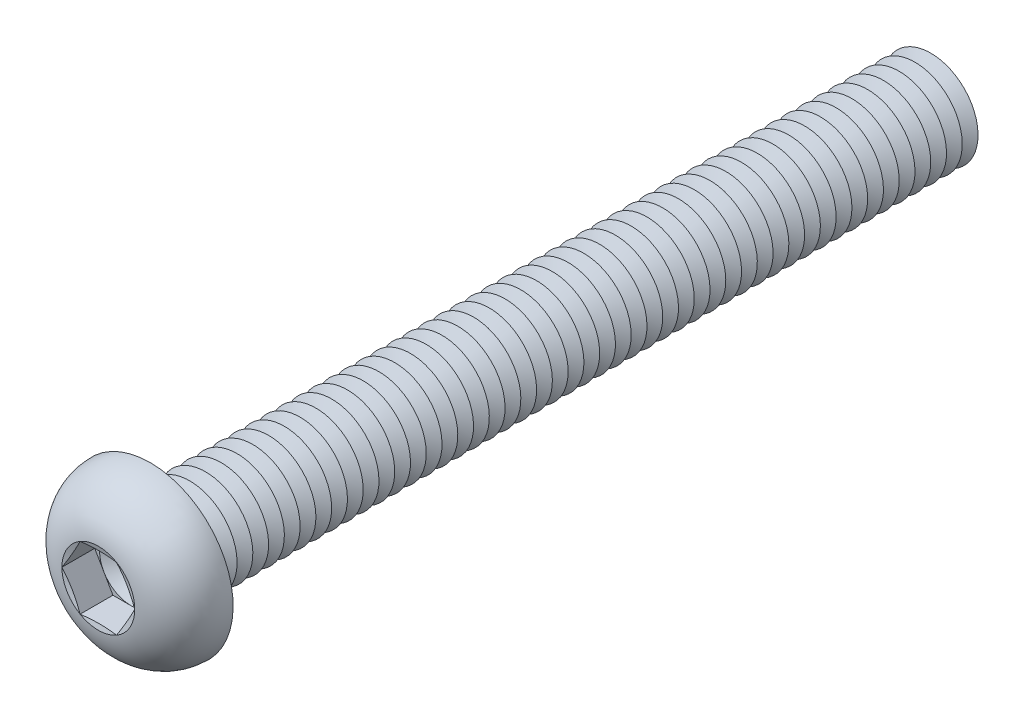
ISO-10303-21;
HEADER;
FILE_DESCRIPTION(('STEP AP214'),'2;1');
FILE_NAME('part.step','',(''),(''),'','','');
FILE_SCHEMA(('AUTOMOTIVE_DESIGN { 1 0 10303 214 1 1 1 1 }'));
ENDSEC;
DATA;
#1=APPLICATION_CONTEXT('core data for automotive mechanical design processes');
#2=APPLICATION_PROTOCOL_DEFINITION('international standard','automotive_design',2000,#1);
#3=PRODUCT_CONTEXT('',#1,'mechanical');
#4=PRODUCT('Part','Part','',(#3));
#5=PRODUCT_RELATED_PRODUCT_CATEGORY('part','',(#4));
#6=PRODUCT_DEFINITION_FORMATION('','',#4);
#7=PRODUCT_DEFINITION_CONTEXT('part definition',#1,'design');
#8=PRODUCT_DEFINITION('design','',#6,#7);
#9=PRODUCT_DEFINITION_SHAPE('','',#8);
#10=(LENGTH_UNIT() NAMED_UNIT(*) SI_UNIT(.MILLI.,.METRE.));
#11=(NAMED_UNIT(*) PLANE_ANGLE_UNIT() SI_UNIT($,.RADIAN.));
#12=(NAMED_UNIT(*) SI_UNIT($,.STERADIAN.) SOLID_ANGLE_UNIT());
#13=UNCERTAINTY_MEASURE_WITH_UNIT(LENGTH_MEASURE(1.E-05),#10,'distance_accuracy_value','');
#14=(GEOMETRIC_REPRESENTATION_CONTEXT(3) GLOBAL_UNCERTAINTY_ASSIGNED_CONTEXT((#13)) GLOBAL_UNIT_ASSIGNED_CONTEXT((#10,
#11,#12)) REPRESENTATION_CONTEXT('',''));
#15=CARTESIAN_POINT('',(0.,0.,0.));
#16=DIRECTION('',(0.,0.,1.));
#17=DIRECTION('',(1.,0.,0.));
#18=AXIS2_PLACEMENT_3D('',#15,#16,#17);
#19=CARTESIAN_POINT('',(0.,0.,1.22));
#20=DIRECTION('',(0.,0.,1.));
#21=DIRECTION('',(1.,0.,0.));
#22=AXIS2_PLACEMENT_3D('',#19,#20,#21);
#23=PLANE('',#22);
#24=CARTESIAN_POINT('',(0.,0.,1.22));
#25=DIRECTION('',(0.,0.,1.));
#26=DIRECTION('',(1.,0.,0.));
#27=AXIS2_PLACEMENT_3D('',#24,#25,#26);
#28=CIRCLE('',#27,1.99999906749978);
#29=CARTESIAN_POINT('',(1.73205,0.999999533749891,1.22));
#30=VERTEX_POINT('',#29);
#31=CARTESIAN_POINT('',(0.,1.99999906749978,1.22));
#32=VERTEX_POINT('',#31);
#33=EDGE_CURVE('E118',#30,#32,#28,.T.);
#34=ORIENTED_EDGE('',*,*,#33,.F.);
#35=DIRECTION('',(-0.5,0.866025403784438,0.));
#36=VECTOR('',#35,1.);
#37=CARTESIAN_POINT('',(2.3094,0.,1.22));
#38=LINE('',#37,#36);
#39=CARTESIAN_POINT('',(1.1547,1.99999906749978,1.22));
#40=VERTEX_POINT('',#39);
#41=EDGE_CURVE('E125',#30,#40,#38,.T.);
#42=ORIENTED_EDGE('',*,*,#41,.T.);
#43=DIRECTION('',(-1.,0.,0.));
#44=VECTOR('',#43,1.);
#45=CARTESIAN_POINT('',(1.1547,1.99999906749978,1.22));
#46=LINE('',#45,#44);
#47=EDGE_CURVE('E136',#40,#32,#46,.T.);
#48=ORIENTED_EDGE('',*,*,#47,.T.);
#49=EDGE_LOOP('',(#34,#42,#48));
#50=FACE_BOUND('',#49,.T.);
#51=ADVANCED_FACE('F39',(#50),#23,.T.);
#52=CARTESIAN_POINT('',(0.,0.,1.22));
#53=DIRECTION('',(0.,0.,1.));
#54=DIRECTION('',(1.,0.,0.));
#55=AXIS2_PLACEMENT_3D('',#52,#53,#54);
#56=CIRCLE('',#55,1.99999906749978);
#57=CARTESIAN_POINT('',(-1.73205,0.999999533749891,1.22));
#58=VERTEX_POINT('',#57);
#59=EDGE_CURVE('E11',#32,#58,#56,.T.);
#60=ORIENTED_EDGE('',*,*,#59,.F.);
#61=CARTESIAN_POINT('',(-1.1547,1.99999906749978,1.22));
#62=VERTEX_POINT('',#61);
#63=EDGE_CURVE('E131',#32,#62,#46,.T.);
#64=ORIENTED_EDGE('',*,*,#63,.T.);
#65=DIRECTION('',(-0.5,-0.866025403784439,0.));
#66=VECTOR('',#65,1.);
#67=CARTESIAN_POINT('',(-1.1547,1.99999906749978,1.22));
#68=LINE('',#67,#66);
#69=EDGE_CURVE('E134',#62,#58,#68,.T.);
#70=ORIENTED_EDGE('',*,*,#69,.T.);
#71=EDGE_LOOP('',(#60,#64,#70));
#72=FACE_BOUND('',#71,.T.);
#73=ADVANCED_FACE('F130',(#72),#23,.T.);
#74=CARTESIAN_POINT('',(-1.73205,-0.999999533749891,1.22));
#75=VERTEX_POINT('',#74);
#76=EDGE_CURVE('E49',#58,#75,#56,.T.);
#77=ORIENTED_EDGE('',*,*,#76,.F.);
#78=CARTESIAN_POINT('',(-2.3094,0.,1.22));
#79=VERTEX_POINT('',#78);
#80=EDGE_CURVE('E143',#58,#79,#68,.T.);
#81=ORIENTED_EDGE('',*,*,#80,.T.);
#82=DIRECTION('',(0.5,-0.866025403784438,0.));
#83=VECTOR('',#82,1.);
#84=CARTESIAN_POINT('',(-2.3094,0.,1.22));
#85=LINE('',#84,#83);
#86=EDGE_CURVE('E151',#79,#75,#85,.T.);
#87=ORIENTED_EDGE('',*,*,#86,.T.);
#88=EDGE_LOOP('',(#77,#81,#87));
#89=FACE_BOUND('',#88,.T.);
#90=ADVANCED_FACE('F669',(#89),#23,.T.);
#91=CARTESIAN_POINT('',(0.,-1.99999906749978,1.22));
#92=VERTEX_POINT('',#91);
#93=EDGE_CURVE('E652',#75,#92,#56,.T.);
#94=ORIENTED_EDGE('',*,*,#93,.F.);
#95=CARTESIAN_POINT('',(-1.1547,-1.99999906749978,1.22));
#96=VERTEX_POINT('',#95);
#97=EDGE_CURVE('E150',#75,#96,#85,.T.);
#98=ORIENTED_EDGE('',*,*,#97,.T.);
#99=DIRECTION('',(1.,0.,0.));
#100=VECTOR('',#99,1.);
#101=CARTESIAN_POINT('',(-1.1547,-1.99999906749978,1.22));
#102=LINE('',#101,#100);
#103=EDGE_CURVE('E156',#96,#92,#102,.T.);
#104=ORIENTED_EDGE('',*,*,#103,.T.);
#105=EDGE_LOOP('',(#94,#98,#104));
#106=FACE_BOUND('',#105,.T.);
#107=ADVANCED_FACE('F662',(#106),#23,.T.);
#108=CARTESIAN_POINT('',(1.73205,-0.999999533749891,1.22));
#109=VERTEX_POINT('',#108);
#110=EDGE_CURVE('E56',#92,#109,#56,.T.);
#111=ORIENTED_EDGE('',*,*,#110,.F.);
#112=CARTESIAN_POINT('',(1.1547,-1.99999906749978,1.22));
#113=VERTEX_POINT('',#112);
#114=EDGE_CURVE('E155',#92,#113,#102,.T.);
#115=ORIENTED_EDGE('',*,*,#114,.T.);
#116=DIRECTION('',(0.5,0.866025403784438,0.));
#117=VECTOR('',#116,1.);
#118=CARTESIAN_POINT('',(1.1547,-1.99999906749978,1.22));
#119=LINE('',#118,#117);
#120=EDGE_CURVE('E161',#113,#109,#119,.T.);
#121=ORIENTED_EDGE('',*,*,#120,.T.);
#122=EDGE_LOOP('',(#111,#115,#121));
#123=FACE_BOUND('',#122,.T.);
#124=ADVANCED_FACE('F737',(#123),#23,.T.);
#125=CARTESIAN_POINT('',(0.,0.,3.3));
#126=DIRECTION('',(0.,0.,1.));
#127=DIRECTION('',(0.,-1.,0.));
#128=AXIS2_PLACEMENT_3D('',#125,#126,#127);
#129=CONICAL_SURFACE('',#128,2.3094,1.30899693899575);
#130=CARTESIAN_POINT('',(2.30951547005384,-0.000200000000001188,3.30003094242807));
#131=CARTESIAN_POINT('',(2.26155412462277,0.0828714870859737,3.2871729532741));
#132=CARTESIAN_POINT('',(2.21350580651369,0.166093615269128,3.27549992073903));
#133=CARTESIAN_POINT('',(2.11723944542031,0.332831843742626,3.2549913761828));
#134=CARTESIAN_POINT('',(2.06902134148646,0.416348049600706,3.24615701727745));
#135=CARTESIAN_POINT('',(1.97270782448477,0.583167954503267,3.23184167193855));
#136=CARTESIAN_POINT('',(1.92461306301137,0.666470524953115,3.22634360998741));
#137=CARTESIAN_POINT('',(1.82836219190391,0.833181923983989,3.21897125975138));
#138=CARTESIAN_POINT('',(1.78020609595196,0.916590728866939,3.21709626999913));
#139=CARTESIAN_POINT('',(1.68389390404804,1.08340833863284,3.21709626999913));
#140=CARTESIAN_POINT('',(1.63573780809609,1.16681714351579,3.21897125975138));
#141=CARTESIAN_POINT('',(1.53948693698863,1.33352854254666,3.22634360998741));
#142=CARTESIAN_POINT('',(1.49139217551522,1.41683111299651,3.23184167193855));
#143=CARTESIAN_POINT('',(1.39507865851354,1.58365101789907,3.24615701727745));
#144=CARTESIAN_POINT('',(1.34686055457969,1.66716722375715,3.2549913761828));
#145=CARTESIAN_POINT('',(1.25059419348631,1.83390545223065,3.27549992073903));
#146=CARTESIAN_POINT('',(1.20254587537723,1.9171275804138,3.2871729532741));
#147=CARTESIAN_POINT('',(1.15458452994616,2.00019906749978,3.30003094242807));
#148=B_SPLINE_CURVE_WITH_KNOTS('',3,(#130,#131,#132,#133,#134,#135,#136,#137,#138,#139,#140,
#141,#142,#143,#144,#145,#146,#147),.UNSPECIFIED.,.F.,.F.,(4,2,2,2,2,2,2,2,4),(0.,
0.290357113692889,0.580832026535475,0.869807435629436,1.15872689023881,1.44764634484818,
1.73662175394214,2.02709666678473,2.31745378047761),.UNSPECIFIED.);
#149=CARTESIAN_POINT('',(2.3094,0.,3.3));
#150=VERTEX_POINT('',#149);
#151=CARTESIAN_POINT('',(1.15469999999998,1.99999906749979,3.3));
#152=VERTEX_POINT('',#151);
#153=EDGE_CURVE('E220',#150,#152,#148,.T.);
#154=ORIENTED_EDGE('',*,*,#153,.F.);
#155=CARTESIAN_POINT('',(0.,0.,3.3));
#156=DIRECTION('',(0.,0.,-1.));
#157=DIRECTION('',(0.,1.,0.));
#158=AXIS2_PLACEMENT_3D('',#155,#156,#157);
#159=CIRCLE('',#158,2.3094);
#160=EDGE_CURVE('E635',#152,#150,#159,.T.);
#161=ORIENTED_EDGE('',*,*,#160,.F.);
#162=EDGE_LOOP('',(#154,#161));
#163=FACE_BOUND('',#162,.T.);
#164=ADVANCED_FACE('F741',(#163),#129,.F.);
#165=CARTESIAN_POINT('',(1.15458452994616,-2.00019906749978,3.30003094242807));
#166=CARTESIAN_POINT('',(1.20254587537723,-1.91712758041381,3.2871729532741));
#167=CARTESIAN_POINT('',(1.25059419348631,-1.83390545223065,3.27549992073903));
#168=CARTESIAN_POINT('',(1.34686055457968,-1.66716722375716,3.2549913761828));
#169=CARTESIAN_POINT('',(1.39507865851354,-1.58365101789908,3.24615701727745));
#170=CARTESIAN_POINT('',(1.49139217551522,-1.41683111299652,3.23184167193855));
#171=CARTESIAN_POINT('',(1.53948693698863,-1.33352854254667,3.22634360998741));
#172=CARTESIAN_POINT('',(1.63573780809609,-1.16681714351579,3.21897125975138));
#173=CARTESIAN_POINT('',(1.68389390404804,-1.08340833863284,3.21709626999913));
#174=CARTESIAN_POINT('',(1.78020609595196,-0.916590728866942,3.21709626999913));
#175=CARTESIAN_POINT('',(1.82836219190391,-0.833181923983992,3.21897125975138));
#176=CARTESIAN_POINT('',(1.92461306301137,-0.666470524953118,3.22634360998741));
#177=CARTESIAN_POINT('',(1.97270782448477,-0.58316795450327,3.23184167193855));
#178=CARTESIAN_POINT('',(2.06902134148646,-0.416348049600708,3.24615701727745));
#179=CARTESIAN_POINT('',(2.11723944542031,-0.332831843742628,3.2549913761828));
#180=CARTESIAN_POINT('',(2.21350580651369,-0.16609361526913,3.27549992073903));
#181=CARTESIAN_POINT('',(2.26155412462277,-0.0828714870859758,3.2871729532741));
#182=CARTESIAN_POINT('',(2.30951547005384,0.000199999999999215,3.30003094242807));
#183=B_SPLINE_CURVE_WITH_KNOTS('',3,(#165,#166,#167,#168,#169,#170,#171,#172,#173,#174,#175,
#176,#177,#178,#179,#180,#181,#182),.UNSPECIFIED.,.F.,.F.,(4,2,2,2,2,2,2,2,4),(0.,
0.290357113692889,0.580832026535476,0.869807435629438,1.15872689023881,1.44764634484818,
1.73662175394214,2.02709666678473,2.31745378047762),.UNSPECIFIED.);
#184=CARTESIAN_POINT('',(1.1547,-1.99999906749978,3.3));
#185=VERTEX_POINT('',#184);
#186=EDGE_CURVE('E229',#185,#150,#183,.T.);
#187=ORIENTED_EDGE('',*,*,#186,.F.);
#188=EDGE_CURVE('E640',#150,#185,#159,.T.);
#189=ORIENTED_EDGE('',*,*,#188,.F.);
#190=EDGE_LOOP('',(#187,#189));
#191=FACE_BOUND('',#190,.T.);
#192=ADVANCED_FACE('F703',(#191),#129,.F.);
#193=CARTESIAN_POINT('',(-3.4849337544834,-1.99999906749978,3.75783251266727));
#194=CARTESIAN_POINT('',(-3.40057136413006,-1.99999906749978,3.73822859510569));
#195=CARTESIAN_POINT('',(-3.31617090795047,-1.99999906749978,3.71878852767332));
#196=CARTESIAN_POINT('',(-3.14727791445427,-1.99999906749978,3.68030638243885));
#197=CARTESIAN_POINT('',(-3.06278537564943,-1.99999906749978,3.66126431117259));
#198=CARTESIAN_POINT('',(-2.80911712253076,-1.99999906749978,3.60483420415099));
#199=CARTESIAN_POINT('',(-2.63978343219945,-1.99999906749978,3.5681499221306));
#200=CARTESIAN_POINT('',(-2.29895421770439,-1.99999906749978,3.49717072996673));
#201=CARTESIAN_POINT('',(-2.12745330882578,-1.99999906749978,3.4629014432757));
#202=CARTESIAN_POINT('',(-1.78364663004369,-1.99999906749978,3.39849485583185));
#203=CARTESIAN_POINT('',(-1.61134079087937,-1.99999906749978,3.36835791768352));
#204=CARTESIAN_POINT('',(-1.27040784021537,-1.99999906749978,3.31501553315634));
#205=CARTESIAN_POINT('',(-1.10180724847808,-1.99999906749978,3.291644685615));
#206=CARTESIAN_POINT('',(-0.763641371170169,-1.99999906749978,3.2533727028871));
#207=CARTESIAN_POINT('',(-0.594076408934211,-1.99999906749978,3.23846888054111));
#208=CARTESIAN_POINT('',(-0.339649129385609,-1.99999906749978,3.22431372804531));
#209=CARTESIAN_POINT('',(-0.255009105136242,-1.99999906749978,3.22096057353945));
#210=CARTESIAN_POINT('',(-0.0856618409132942,-1.99999906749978,3.21711210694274));
#211=CARTESIAN_POINT('',(-0.000954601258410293,-1.99999906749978,3.2166167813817));
#212=CARTESIAN_POINT('',(0.16843098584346,-1.99999906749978,3.21851478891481));
#213=CARTESIAN_POINT('',(0.253109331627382,-1.99999906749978,3.2209082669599));
#214=CARTESIAN_POINT('',(0.422344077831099,-1.99999906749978,3.22845792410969));
#215=CARTESIAN_POINT('',(0.506900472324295,-1.99999906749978,3.23361423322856));
#216=CARTESIAN_POINT('',(0.712240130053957,-1.99999906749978,3.24921577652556));
#217=CARTESIAN_POINT('',(0.832922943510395,-1.99999906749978,3.26098285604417));
#218=CARTESIAN_POINT('',(1.07378161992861,-1.99999906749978,3.28874908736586));
#219=CARTESIAN_POINT('',(1.1939575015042,-1.99999906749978,3.30474808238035));
#220=CARTESIAN_POINT('',(1.43419655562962,-1.99999906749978,3.34009172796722));
#221=CARTESIAN_POINT('',(1.55425817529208,-1.99999906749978,3.35944677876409));
#222=CARTESIAN_POINT('',(1.79394991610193,-1.99999906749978,3.40067076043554));
#223=CARTESIAN_POINT('',(1.91358001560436,-1.99999906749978,3.42253981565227));
#224=CARTESIAN_POINT('',(2.15493405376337,-1.99999906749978,3.46864194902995));
#225=CARTESIAN_POINT('',(2.27665041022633,-1.99999906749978,3.49291441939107));
#226=CARTESIAN_POINT('',(2.51977680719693,-1.99999906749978,3.54294628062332));
#227=CARTESIAN_POINT('',(2.64118684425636,-1.99999906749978,3.56870568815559));
#228=CARTESIAN_POINT('',(2.88310060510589,-1.99999906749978,3.62120891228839));
#229=CARTESIAN_POINT('',(3.00360566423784,-1.99999906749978,3.6479466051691));
#230=CARTESIAN_POINT('',(3.24441021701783,-1.99999906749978,3.7022947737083));
#231=CARTESIAN_POINT('',(3.36470972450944,-1.99999906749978,3.72990518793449));
#232=CARTESIAN_POINT('',(3.4849337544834,-1.99999906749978,3.75783251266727));
#233=B_SPLINE_CURVE_WITH_KNOTS('',3,(#193,#194,#195,#196,#197,#198,#199,#200,#201,#202,#203,
#204,#205,#206,#207,#208,#209,#210,#211,#212,#213,#214,#215,#216,#217,#218,#219,#220,#221,#222,
#223,#224,#225,#226,#227,#228,#229,#230,#231,#232),.UNSPECIFIED.,.F.,.F.,(4,2,2,2,2,2,2,2,2,2,2,
2,2,2,2,2,2,2,2,4),(0.,0.259830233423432,0.519664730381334,1.03943435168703,1.56407662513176,
2.08876490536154,2.59926476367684,3.10960251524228,3.36367930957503,3.61775490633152,
3.87184325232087,4.1259435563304,4.48960924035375,4.85326145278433,5.21806142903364,
5.58287945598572,5.95520617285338,6.32753706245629,6.69784064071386,7.06811821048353),.UNSPECIFIED.);
#234=CARTESIAN_POINT('',(-1.1547,-1.99999906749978,3.3));
#235=VERTEX_POINT('',#234);
#236=EDGE_CURVE('E683',#235,#185,#233,.T.);
#237=ORIENTED_EDGE('',*,*,#236,.F.);
#238=EDGE_CURVE('E695',#185,#235,#159,.T.);
#239=ORIENTED_EDGE('',*,*,#238,.F.);
#240=EDGE_LOOP('',(#237,#239));
#241=FACE_BOUND('',#240,.T.);
#242=ADVANCED_FACE('F709',(#241),#129,.F.);
#243=CARTESIAN_POINT('',(-2.30951547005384,0.00019999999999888,3.30003094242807));
#244=CARTESIAN_POINT('',(-2.26155412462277,-0.0828714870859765,3.2871729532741));
#245=CARTESIAN_POINT('',(-2.21350580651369,-0.166093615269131,3.27549992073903));
#246=CARTESIAN_POINT('',(-2.11723944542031,-0.332831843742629,3.2549913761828));
#247=CARTESIAN_POINT('',(-2.06902134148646,-0.416348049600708,3.24615701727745));
#248=CARTESIAN_POINT('',(-1.97270782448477,-0.58316795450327,3.23184167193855));
#249=CARTESIAN_POINT('',(-1.92461306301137,-0.666470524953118,3.22634360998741));
#250=CARTESIAN_POINT('',(-1.82836219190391,-0.833181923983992,3.21897125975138));
#251=CARTESIAN_POINT('',(-1.78020609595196,-0.916590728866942,3.21709626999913));
#252=CARTESIAN_POINT('',(-1.68389390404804,-1.08340833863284,3.21709626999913));
#253=CARTESIAN_POINT('',(-1.63573780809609,-1.16681714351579,3.21897125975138));
#254=CARTESIAN_POINT('',(-1.53948693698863,-1.33352854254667,3.22634360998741));
#255=CARTESIAN_POINT('',(-1.49139217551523,-1.41683111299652,3.23184167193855));
#256=CARTESIAN_POINT('',(-1.39507865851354,-1.58365101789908,3.24615701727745));
#257=CARTESIAN_POINT('',(-1.34686055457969,-1.66716722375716,3.2549913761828));
#258=CARTESIAN_POINT('',(-1.25059419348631,-1.83390545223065,3.27549992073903));
#259=CARTESIAN_POINT('',(-1.20254587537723,-1.91712758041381,3.2871729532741));
#260=CARTESIAN_POINT('',(-1.15458452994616,-2.00019906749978,3.30003094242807));
#261=B_SPLINE_CURVE_WITH_KNOTS('',3,(#243,#244,#245,#246,#247,#248,#249,#250,#251,#252,#253,
#254,#255,#256,#257,#258,#259,#260),.UNSPECIFIED.,.F.,.F.,(4,2,2,2,2,2,2,2,4),(0.,
0.290357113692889,0.580832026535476,0.869807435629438,1.15872689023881,1.44764634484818,
1.73662175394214,2.02709666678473,2.31745378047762),.UNSPECIFIED.);
#262=CARTESIAN_POINT('',(-2.3094,0.,3.3));
#263=VERTEX_POINT('',#262);
#264=EDGE_CURVE('E674',#263,#235,#261,.T.);
#265=ORIENTED_EDGE('',*,*,#264,.F.);
#266=EDGE_CURVE('E680',#235,#263,#159,.T.);
#267=ORIENTED_EDGE('',*,*,#266,.F.);
#268=EDGE_LOOP('',(#265,#267));
#269=FACE_BOUND('',#268,.T.);
#270=ADVANCED_FACE('F678',(#269),#129,.F.);
#271=CARTESIAN_POINT('',(-1.15458452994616,2.00019906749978,3.30003094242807));
#272=CARTESIAN_POINT('',(-1.20254587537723,1.9171275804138,3.2871729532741));
#273=CARTESIAN_POINT('',(-1.25059419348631,1.83390545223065,3.27549992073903));
#274=CARTESIAN_POINT('',(-1.34686055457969,1.66716722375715,3.2549913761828));
#275=CARTESIAN_POINT('',(-1.39507865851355,1.58365101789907,3.24615701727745));
#276=CARTESIAN_POINT('',(-1.49139217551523,1.41683111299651,3.23184167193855));
#277=CARTESIAN_POINT('',(-1.53948693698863,1.33352854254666,3.22634360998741));
#278=CARTESIAN_POINT('',(-1.63573780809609,1.16681714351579,3.21897125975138));
#279=CARTESIAN_POINT('',(-1.68389390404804,1.08340833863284,3.21709626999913));
#280=CARTESIAN_POINT('',(-1.78020609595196,0.916590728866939,3.21709626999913));
#281=CARTESIAN_POINT('',(-1.82836219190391,0.833181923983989,3.21897125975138));
#282=CARTESIAN_POINT('',(-1.92461306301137,0.666470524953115,3.22634360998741));
#283=CARTESIAN_POINT('',(-1.97270782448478,0.583167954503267,3.23184167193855));
#284=CARTESIAN_POINT('',(-2.06902134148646,0.416348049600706,3.24615701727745));
#285=CARTESIAN_POINT('',(-2.11723944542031,0.332831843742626,3.2549913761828));
#286=CARTESIAN_POINT('',(-2.21350580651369,0.166093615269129,3.27549992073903));
#287=CARTESIAN_POINT('',(-2.26155412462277,0.0828714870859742,3.2871729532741));
#288=CARTESIAN_POINT('',(-2.30951547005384,-0.000200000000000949,3.30003094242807));
#289=B_SPLINE_CURVE_WITH_KNOTS('',3,(#271,#272,#273,#274,#275,#276,#277,#278,#279,#280,#281,
#282,#283,#284,#285,#286,#287,#288),.UNSPECIFIED.,.F.,.F.,(4,2,2,2,2,2,2,2,4),(0.,
0.290357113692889,0.580832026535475,0.869807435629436,1.15872689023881,1.44764634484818,
1.73662175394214,2.02709666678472,2.31745378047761),.UNSPECIFIED.);
#290=CARTESIAN_POINT('',(-1.1547,1.99999906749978,3.3));
#291=VERTEX_POINT('',#290);
#292=EDGE_CURVE('E194',#291,#263,#289,.T.);
#293=ORIENTED_EDGE('',*,*,#292,.F.);
#294=EDGE_CURVE('E686',#263,#291,#159,.T.);
#295=ORIENTED_EDGE('',*,*,#294,.F.);
#296=EDGE_LOOP('',(#293,#295));
#297=FACE_BOUND('',#296,.T.);
#298=ADVANCED_FACE('F687',(#297),#129,.F.);
#299=CARTESIAN_POINT('',(0.,0.,-46.5));
#300=DIRECTION('',(0.,0.,1.));
#301=DIRECTION('',(0.,-1.,0.));
#302=AXIS2_PLACEMENT_3D('',#299,#300,#301);
#303=CONICAL_SURFACE('',#302,2.99999999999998,1.0471975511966);
#304=CARTESIAN_POINT('',(0.,0.,-47.));
#305=DIRECTION('',(0.,0.,1.));
#306=DIRECTION('',(0.,-1.,0.));
#307=AXIS2_PLACEMENT_3D('',#304,#305,#306);
#308=CIRCLE('',#307,2.13397459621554);
#309=CARTESIAN_POINT('',(0.,-2.13397459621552,-47.));
#310=VERTEX_POINT('',#309);
#311=EDGE_CURVE('E606',#310,#310,#308,.T.);
#312=ORIENTED_EDGE('',*,*,#311,.T.);
#313=EDGE_LOOP('',(#312));
#314=FACE_BOUND('',#313,.T.);
#315=CARTESIAN_POINT('',(0.,0.,-46.5));
#316=DIRECTION('',(0.,0.,1.));
#317=DIRECTION('',(0.,-1.,0.));
#318=AXIS2_PLACEMENT_3D('',#315,#316,#317);
#319=CIRCLE('',#318,2.99999999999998);
#320=CARTESIAN_POINT('',(0.,-2.99999999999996,-46.5));
#321=VERTEX_POINT('',#320);
#322=EDGE_CURVE('E602',#321,#321,#319,.T.);
#323=ORIENTED_EDGE('',*,*,#322,.F.);
#324=EDGE_LOOP('',(#323));
#325=FACE_BOUND('',#324,.T.);
#326=ADVANCED_FACE('F769',(#314,#325),#303,.T.);
#327=CARTESIAN_POINT('',(0.,0.,-47.));
#328=DIRECTION('',(0.,0.,-1.));
#329=DIRECTION('',(0.,1.,0.));
#330=AXIS2_PLACEMENT_3D('',#327,#328,#329);
#331=CONICAL_SURFACE('',#330,2.13397459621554,1.0471975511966);
#332=CARTESIAN_POINT('',(0.,0.,-47.5));
#333=DIRECTION('',(0.,0.,1.));
#334=DIRECTION('',(0.,-1.,0.));
#335=AXIS2_PLACEMENT_3D('',#332,#333,#334);
#336=CIRCLE('',#335,2.99999999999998);
#337=CARTESIAN_POINT('',(0.,-2.99999999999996,-47.5));
#338=VERTEX_POINT('',#337);
#339=EDGE_CURVE('E610',#338,#338,#336,.T.);
#340=ORIENTED_EDGE('',*,*,#339,.T.);
#341=EDGE_LOOP('',(#340));
#342=FACE_BOUND('',#341,.T.);
#343=ORIENTED_EDGE('',*,*,#311,.F.);
#344=EDGE_LOOP('',(#343));
#345=FACE_BOUND('',#344,.T.);
#346=ADVANCED_FACE('F774',(#342,#345),#331,.T.);
#347=CARTESIAN_POINT('',(0.,2.99999999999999,-50.));
#348=DIRECTION('',(0.,0.,-1.));
#349=DIRECTION('',(0.,1.,0.));
#350=AXIS2_PLACEMENT_3D('',#347,#348,#349);
#351=PLANE('',#350);
#352=CARTESIAN_POINT('',(0.,0.,-50.));
#353=DIRECTION('',(0.,0.,1.));
#354=DIRECTION('',(0.,-1.,0.));
#355=AXIS2_PLACEMENT_3D('',#352,#353,#354);
#356=CIRCLE('',#355,2.13397459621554);
#357=CARTESIAN_POINT('',(0.,-2.13397459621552,-50.));
#358=VERTEX_POINT('',#357);
#359=EDGE_CURVE('E630',#358,#358,#356,.T.);
#360=ORIENTED_EDGE('',*,*,#359,.F.);
#361=EDGE_LOOP('',(#360));
#362=FACE_BOUND('',#361,.T.);
#363=ADVANCED_FACE('F941',(#362),#351,.T.);
#364=CARTESIAN_POINT('',(0.,0.,-49.5));
#365=DIRECTION('',(0.,0.,1.));
#366=DIRECTION('',(0.,-1.,0.));
#367=AXIS2_PLACEMENT_3D('',#364,#365,#366);
#368=CONICAL_SURFACE('',#367,2.99999999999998,1.0471975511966);
#369=ORIENTED_EDGE('',*,*,#359,.T.);
#370=EDGE_LOOP('',(#369));
#371=FACE_BOUND('',#370,.T.);
#372=CARTESIAN_POINT('',(0.,0.,-49.5));
#373=DIRECTION('',(0.,0.,1.));
#374=DIRECTION('',(0.,-1.,0.));
#375=AXIS2_PLACEMENT_3D('',#372,#373,#374);
#376=CIRCLE('',#375,2.99999999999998);
#377=CARTESIAN_POINT('',(0.,-2.99999999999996,-49.5));
#378=VERTEX_POINT('',#377);
#379=EDGE_CURVE('E626',#378,#378,#376,.T.);
#380=ORIENTED_EDGE('',*,*,#379,.F.);
#381=EDGE_LOOP('',(#380));
#382=FACE_BOUND('',#381,.T.);
#383=ADVANCED_FACE('F934',(#371,#382),#368,.T.);
#384=CARTESIAN_POINT('',(0.,0.,-49.));
#385=DIRECTION('',(0.,0.,-1.));
#386=DIRECTION('',(0.,1.,0.));
#387=AXIS2_PLACEMENT_3D('',#384,#385,#386);
#388=CONICAL_SURFACE('',#387,2.13397459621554,1.0471975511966);
#389=ORIENTED_EDGE('',*,*,#379,.T.);
#390=EDGE_LOOP('',(#389));
#391=FACE_BOUND('',#390,.T.);
#392=CARTESIAN_POINT('',(0.,0.,-49.));
#393=DIRECTION('',(0.,0.,1.));
#394=DIRECTION('',(0.,-1.,0.));
#395=AXIS2_PLACEMENT_3D('',#392,#393,#394);
#396=CIRCLE('',#395,2.13397459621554);
#397=CARTESIAN_POINT('',(0.,-2.13397459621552,-49.));
#398=VERTEX_POINT('',#397);
#399=EDGE_CURVE('E622',#398,#398,#396,.T.);
#400=ORIENTED_EDGE('',*,*,#399,.F.);
#401=EDGE_LOOP('',(#400));
#402=FACE_BOUND('',#401,.T.);
#403=ADVANCED_FACE('F940',(#391,#402),#388,.T.);
#404=CARTESIAN_POINT('',(0.,0.,-48.5));
#405=DIRECTION('',(0.,0.,1.));
#406=DIRECTION('',(0.,-1.,0.));
#407=AXIS2_PLACEMENT_3D('',#404,#405,#406);
#408=CONICAL_SURFACE('',#407,2.99999999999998,1.0471975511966);
#409=ORIENTED_EDGE('',*,*,#399,.T.);
#410=EDGE_LOOP('',(#409));
#411=FACE_BOUND('',#410,.T.);
#412=CARTESIAN_POINT('',(0.,0.,-48.5));
#413=DIRECTION('',(0.,0.,1.));
#414=DIRECTION('',(0.,-1.,0.));
#415=AXIS2_PLACEMENT_3D('',#412,#413,#414);
#416=CIRCLE('',#415,2.99999999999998);
#417=CARTESIAN_POINT('',(0.,-2.99999999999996,-48.5));
#418=VERTEX_POINT('',#417);
#419=EDGE_CURVE('E618',#418,#418,#416,.T.);
#420=ORIENTED_EDGE('',*,*,#419,.F.);
#421=EDGE_LOOP('',(#420));
#422=FACE_BOUND('',#421,.T.);
#423=ADVANCED_FACE('F972',(#411,#422),#408,.T.);
#424=CARTESIAN_POINT('',(0.,0.,-48.));
#425=DIRECTION('',(0.,0.,-1.));
#426=DIRECTION('',(0.,1.,0.));
#427=AXIS2_PLACEMENT_3D('',#424,#425,#426);
#428=CONICAL_SURFACE('',#427,2.13397459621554,1.0471975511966);
#429=ORIENTED_EDGE('',*,*,#419,.T.);
#430=EDGE_LOOP('',(#429));
#431=FACE_BOUND('',#430,.T.);
#432=CARTESIAN_POINT('',(0.,0.,-48.));
#433=DIRECTION('',(0.,0.,1.));
#434=DIRECTION('',(0.,-1.,0.));
#435=AXIS2_PLACEMENT_3D('',#432,#433,#434);
#436=CIRCLE('',#435,2.13397459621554);
#437=CARTESIAN_POINT('',(0.,-2.13397459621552,-48.));
#438=VERTEX_POINT('',#437);
#439=EDGE_CURVE('E614',#438,#438,#436,.T.);
#440=ORIENTED_EDGE('',*,*,#439,.F.);
#441=EDGE_LOOP('',(#440));
#442=FACE_BOUND('',#441,.T.);
#443=ADVANCED_FACE('F982',(#431,#442),#428,.T.);
#444=CARTESIAN_POINT('',(0.,0.,-47.5));
#445=DIRECTION('',(0.,0.,1.));
#446=DIRECTION('',(0.,-1.,0.));
#447=AXIS2_PLACEMENT_3D('',#444,#445,#446);
#448=CONICAL_SURFACE('',#447,2.99999999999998,1.0471975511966);
#449=ORIENTED_EDGE('',*,*,#439,.T.);
#450=EDGE_LOOP('',(#449));
#451=FACE_BOUND('',#450,.T.);
#452=ORIENTED_EDGE('',*,*,#339,.F.);
#453=EDGE_LOOP('',(#452));
#454=FACE_BOUND('',#453,.T.);
#455=ADVANCED_FACE('F992',(#451,#454),#448,.T.);
#456=CARTESIAN_POINT('',(0.,0.,-45.5));
#457=DIRECTION('',(0.,0.,1.));
#458=DIRECTION('',(0.,-1.,0.));
#459=AXIS2_PLACEMENT_3D('',#456,#457,#458);
#460=CONICAL_SURFACE('',#459,2.99999999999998,1.0471975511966);
#461=CARTESIAN_POINT('',(0.,0.,-46.));
#462=DIRECTION('',(0.,0.,1.));
#463=DIRECTION('',(0.,-1.,0.));
#464=AXIS2_PLACEMENT_3D('',#461,#462,#463);
#465=CIRCLE('',#464,2.13397459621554);
#466=CARTESIAN_POINT('',(0.,-2.13397459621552,-46.));
#467=VERTEX_POINT('',#466);
#468=EDGE_CURVE('E598',#467,#467,#465,.T.);
#469=ORIENTED_EDGE('',*,*,#468,.T.);
#470=EDGE_LOOP('',(#469));
#471=FACE_BOUND('',#470,.T.);
#472=CARTESIAN_POINT('',(0.,0.,-45.5));
#473=DIRECTION('',(0.,0.,1.));
#474=DIRECTION('',(0.,-1.,0.));
#475=AXIS2_PLACEMENT_3D('',#472,#473,#474);
#476=CIRCLE('',#475,2.99999999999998);
#477=CARTESIAN_POINT('',(0.,-2.99999999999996,-45.5));
#478=VERTEX_POINT('',#477);
#479=EDGE_CURVE('E594',#478,#478,#476,.T.);
#480=ORIENTED_EDGE('',*,*,#479,.F.);
#481=EDGE_LOOP('',(#480));
#482=FACE_BOUND('',#481,.T.);
#483=ADVANCED_FACE('F1002',(#471,#482),#460,.T.);
#484=CARTESIAN_POINT('',(0.,0.,-46.));
#485=DIRECTION('',(0.,0.,-1.));
#486=DIRECTION('',(0.,1.,0.));
#487=AXIS2_PLACEMENT_3D('',#484,#485,#486);
#488=CONICAL_SURFACE('',#487,2.13397459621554,1.0471975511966);
#489=ORIENTED_EDGE('',*,*,#322,.T.);
#490=EDGE_LOOP('',(#489));
#491=FACE_BOUND('',#490,.T.);
#492=ORIENTED_EDGE('',*,*,#468,.F.);
#493=EDGE_LOOP('',(#492));
#494=FACE_BOUND('',#493,.T.);
#495=ADVANCED_FACE('F1012',(#491,#494),#488,.T.);
#496=CARTESIAN_POINT('',(0.,0.,-44.5));
#497=DIRECTION('',(0.,0.,1.));
#498=DIRECTION('',(0.,-1.,0.));
#499=AXIS2_PLACEMENT_3D('',#496,#497,#498);
#500=CONICAL_SURFACE('',#499,2.99999999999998,1.0471975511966);
#501=CARTESIAN_POINT('',(0.,0.,-45.));
#502=DIRECTION('',(0.,0.,1.));
#503=DIRECTION('',(0.,-1.,0.));
#504=AXIS2_PLACEMENT_3D('',#501,#502,#503);
#505=CIRCLE('',#504,2.13397459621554);
#506=CARTESIAN_POINT('',(0.,-2.13397459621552,-45.));
#507=VERTEX_POINT('',#506);
#508=EDGE_CURVE('E590',#507,#507,#505,.T.);
#509=ORIENTED_EDGE('',*,*,#508,.T.);
#510=EDGE_LOOP('',(#509));
#511=FACE_BOUND('',#510,.T.);
#512=CARTESIAN_POINT('',(0.,0.,-44.5));
#513=DIRECTION('',(0.,0.,1.));
#514=DIRECTION('',(0.,-1.,0.));
#515=AXIS2_PLACEMENT_3D('',#512,#513,#514);
#516=CIRCLE('',#515,2.99999999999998);
#517=CARTESIAN_POINT('',(0.,-2.99999999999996,-44.5));
#518=VERTEX_POINT('',#517);
#519=EDGE_CURVE('E586',#518,#518,#516,.T.);
#520=ORIENTED_EDGE('',*,*,#519,.F.);
#521=EDGE_LOOP('',(#520));
#522=FACE_BOUND('',#521,.T.);
#523=ADVANCED_FACE('F1022',(#511,#522),#500,.T.);
#524=CARTESIAN_POINT('',(0.,0.,-45.));
#525=DIRECTION('',(0.,0.,-1.));
#526=DIRECTION('',(0.,1.,0.));
#527=AXIS2_PLACEMENT_3D('',#524,#525,#526);
#528=CONICAL_SURFACE('',#527,2.13397459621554,1.0471975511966);
#529=ORIENTED_EDGE('',*,*,#479,.T.);
#530=EDGE_LOOP('',(#529));
#531=FACE_BOUND('',#530,.T.);
#532=ORIENTED_EDGE('',*,*,#508,.F.);
#533=EDGE_LOOP('',(#532));
#534=FACE_BOUND('',#533,.T.);
#535=ADVANCED_FACE('F1032',(#531,#534),#528,.T.);
#536=CARTESIAN_POINT('',(0.,0.,-43.5));
#537=DIRECTION('',(0.,0.,1.));
#538=DIRECTION('',(0.,-1.,0.));
#539=AXIS2_PLACEMENT_3D('',#536,#537,#538);
#540=CONICAL_SURFACE('',#539,2.99999999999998,1.0471975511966);
#541=CARTESIAN_POINT('',(0.,0.,-44.));
#542=DIRECTION('',(0.,0.,1.));
#543=DIRECTION('',(0.,-1.,0.));
#544=AXIS2_PLACEMENT_3D('',#541,#542,#543);
#545=CIRCLE('',#544,2.13397459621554);
#546=CARTESIAN_POINT('',(0.,-2.13397459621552,-44.));
#547=VERTEX_POINT('',#546);
#548=EDGE_CURVE('E582',#547,#547,#545,.T.);
#549=ORIENTED_EDGE('',*,*,#548,.T.);
#550=EDGE_LOOP('',(#549));
#551=FACE_BOUND('',#550,.T.);
#552=CARTESIAN_POINT('',(0.,0.,-43.5));
#553=DIRECTION('',(0.,0.,1.));
#554=DIRECTION('',(0.,-1.,0.));
#555=AXIS2_PLACEMENT_3D('',#552,#553,#554);
#556=CIRCLE('',#555,2.99999999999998);
#557=CARTESIAN_POINT('',(0.,-2.99999999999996,-43.5));
#558=VERTEX_POINT('',#557);
#559=EDGE_CURVE('E578',#558,#558,#556,.T.);
#560=ORIENTED_EDGE('',*,*,#559,.F.);
#561=EDGE_LOOP('',(#560));
#562=FACE_BOUND('',#561,.T.);
#563=ADVANCED_FACE('F1042',(#551,#562),#540,.T.);
#564=CARTESIAN_POINT('',(0.,0.,-44.));
#565=DIRECTION('',(0.,0.,-1.));
#566=DIRECTION('',(0.,1.,0.));
#567=AXIS2_PLACEMENT_3D('',#564,#565,#566);
#568=CONICAL_SURFACE('',#567,2.13397459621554,1.0471975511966);
#569=ORIENTED_EDGE('',*,*,#519,.T.);
#570=EDGE_LOOP('',(#569));
#571=FACE_BOUND('',#570,.T.);
#572=ORIENTED_EDGE('',*,*,#548,.F.);
#573=EDGE_LOOP('',(#572));
#574=FACE_BOUND('',#573,.T.);
#575=ADVANCED_FACE('F1052',(#571,#574),#568,.T.);
#576=CARTESIAN_POINT('',(0.,0.,-42.5));
#577=DIRECTION('',(0.,0.,1.));
#578=DIRECTION('',(0.,-1.,0.));
#579=AXIS2_PLACEMENT_3D('',#576,#577,#578);
#580=CONICAL_SURFACE('',#579,2.99999999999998,1.0471975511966);
#581=CARTESIAN_POINT('',(0.,0.,-43.));
#582=DIRECTION('',(0.,0.,1.));
#583=DIRECTION('',(0.,-1.,0.));
#584=AXIS2_PLACEMENT_3D('',#581,#582,#583);
#585=CIRCLE('',#584,2.13397459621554);
#586=CARTESIAN_POINT('',(0.,-2.13397459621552,-43.));
#587=VERTEX_POINT('',#586);
#588=EDGE_CURVE('E574',#587,#587,#585,.T.);
#589=ORIENTED_EDGE('',*,*,#588,.T.);
#590=EDGE_LOOP('',(#589));
#591=FACE_BOUND('',#590,.T.);
#592=CARTESIAN_POINT('',(0.,0.,-42.5));
#593=DIRECTION('',(0.,0.,1.));
#594=DIRECTION('',(0.,-1.,0.));
#595=AXIS2_PLACEMENT_3D('',#592,#593,#594);
#596=CIRCLE('',#595,2.99999999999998);
#597=CARTESIAN_POINT('',(0.,-2.99999999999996,-42.5));
#598=VERTEX_POINT('',#597);
#599=EDGE_CURVE('E570',#598,#598,#596,.T.);
#600=ORIENTED_EDGE('',*,*,#599,.F.);
#601=EDGE_LOOP('',(#600));
#602=FACE_BOUND('',#601,.T.);
#603=ADVANCED_FACE('F1062',(#591,#602),#580,.T.);
#604=CARTESIAN_POINT('',(0.,0.,-43.));
#605=DIRECTION('',(0.,0.,-1.));
#606=DIRECTION('',(0.,1.,0.));
#607=AXIS2_PLACEMENT_3D('',#604,#605,#606);
#608=CONICAL_SURFACE('',#607,2.13397459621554,1.0471975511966);
#609=ORIENTED_EDGE('',*,*,#559,.T.);
#610=EDGE_LOOP('',(#609));
#611=FACE_BOUND('',#610,.T.);
#612=ORIENTED_EDGE('',*,*,#588,.F.);
#613=EDGE_LOOP('',(#612));
#614=FACE_BOUND('',#613,.T.);
#615=ADVANCED_FACE('F1072',(#611,#614),#608,.T.);
#616=CARTESIAN_POINT('',(0.,0.,-41.5));
#617=DIRECTION('',(0.,0.,1.));
#618=DIRECTION('',(0.,-1.,0.));
#619=AXIS2_PLACEMENT_3D('',#616,#617,#618);
#620=CONICAL_SURFACE('',#619,2.99999999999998,1.0471975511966);
#621=CARTESIAN_POINT('',(0.,0.,-42.));
#622=DIRECTION('',(0.,0.,1.));
#623=DIRECTION('',(0.,-1.,0.));
#624=AXIS2_PLACEMENT_3D('',#621,#622,#623);
#625=CIRCLE('',#624,2.13397459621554);
#626=CARTESIAN_POINT('',(0.,-2.13397459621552,-42.));
#627=VERTEX_POINT('',#626);
#628=EDGE_CURVE('E566',#627,#627,#625,.T.);
#629=ORIENTED_EDGE('',*,*,#628,.T.);
#630=EDGE_LOOP('',(#629));
#631=FACE_BOUND('',#630,.T.);
#632=CARTESIAN_POINT('',(0.,0.,-41.5));
#633=DIRECTION('',(0.,0.,1.));
#634=DIRECTION('',(0.,-1.,0.));
#635=AXIS2_PLACEMENT_3D('',#632,#633,#634);
#636=CIRCLE('',#635,2.99999999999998);
#637=CARTESIAN_POINT('',(0.,-2.99999999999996,-41.5));
#638=VERTEX_POINT('',#637);
#639=EDGE_CURVE('E562',#638,#638,#636,.T.);
#640=ORIENTED_EDGE('',*,*,#639,.F.);
#641=EDGE_LOOP('',(#640));
#642=FACE_BOUND('',#641,.T.);
#643=ADVANCED_FACE('F1082',(#631,#642),#620,.T.);
#644=CARTESIAN_POINT('',(0.,0.,-42.));
#645=DIRECTION('',(0.,0.,-1.));
#646=DIRECTION('',(0.,1.,0.));
#647=AXIS2_PLACEMENT_3D('',#644,#645,#646);
#648=CONICAL_SURFACE('',#647,2.13397459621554,1.0471975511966);
#649=ORIENTED_EDGE('',*,*,#599,.T.);
#650=EDGE_LOOP('',(#649));
#651=FACE_BOUND('',#650,.T.);
#652=ORIENTED_EDGE('',*,*,#628,.F.);
#653=EDGE_LOOP('',(#652));
#654=FACE_BOUND('',#653,.T.);
#655=ADVANCED_FACE('F1092',(#651,#654),#648,.T.);
#656=CARTESIAN_POINT('',(0.,0.,-40.5));
#657=DIRECTION('',(0.,0.,1.));
#658=DIRECTION('',(0.,-1.,0.));
#659=AXIS2_PLACEMENT_3D('',#656,#657,#658);
#660=CONICAL_SURFACE('',#659,2.99999999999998,1.0471975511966);
#661=CARTESIAN_POINT('',(0.,0.,-41.));
#662=DIRECTION('',(0.,0.,1.));
#663=DIRECTION('',(0.,-1.,0.));
#664=AXIS2_PLACEMENT_3D('',#661,#662,#663);
#665=CIRCLE('',#664,2.13397459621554);
#666=CARTESIAN_POINT('',(0.,-2.13397459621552,-41.));
#667=VERTEX_POINT('',#666);
#668=EDGE_CURVE('E558',#667,#667,#665,.T.);
#669=ORIENTED_EDGE('',*,*,#668,.T.);
#670=EDGE_LOOP('',(#669));
#671=FACE_BOUND('',#670,.T.);
#672=CARTESIAN_POINT('',(0.,0.,-40.5));
#673=DIRECTION('',(0.,0.,1.));
#674=DIRECTION('',(0.,-1.,0.));
#675=AXIS2_PLACEMENT_3D('',#672,#673,#674);
#676=CIRCLE('',#675,2.99999999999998);
#677=CARTESIAN_POINT('',(0.,-2.99999999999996,-40.5));
#678=VERTEX_POINT('',#677);
#679=EDGE_CURVE('E555',#678,#678,#676,.T.);
#680=ORIENTED_EDGE('',*,*,#679,.F.);
#681=EDGE_LOOP('',(#680));
#682=FACE_BOUND('',#681,.T.);
#683=ADVANCED_FACE('F1102',(#671,#682),#660,.T.);
#684=CARTESIAN_POINT('',(0.,0.,-41.));
#685=DIRECTION('',(0.,0.,-1.));
#686=DIRECTION('',(0.,1.,0.));
#687=AXIS2_PLACEMENT_3D('',#684,#685,#686);
#688=CONICAL_SURFACE('',#687,2.13397459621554,1.0471975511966);
#689=ORIENTED_EDGE('',*,*,#639,.T.);
#690=EDGE_LOOP('',(#689));
#691=FACE_BOUND('',#690,.T.);
#692=ORIENTED_EDGE('',*,*,#668,.F.);
#693=EDGE_LOOP('',(#692));
#694=FACE_BOUND('',#693,.T.);
#695=ADVANCED_FACE('F1112',(#691,#694),#688,.T.);
#696=CARTESIAN_POINT('',(0.,0.,-39.5));
#697=DIRECTION('',(0.,0.,1.));
#698=DIRECTION('',(0.,-1.,0.));
#699=AXIS2_PLACEMENT_3D('',#696,#697,#698);
#700=CONICAL_SURFACE('',#699,2.99999999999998,1.0471975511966);
#701=CARTESIAN_POINT('',(0.,0.,-40.));
#702=DIRECTION('',(0.,0.,1.));
#703=DIRECTION('',(0.,-1.,0.));
#704=AXIS2_PLACEMENT_3D('',#701,#702,#703);
#705=CIRCLE('',#704,2.13397459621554);
#706=CARTESIAN_POINT('',(0.,-2.13397459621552,-40.));
#707=VERTEX_POINT('',#706);
#708=EDGE_CURVE('E551',#707,#707,#705,.T.);
#709=ORIENTED_EDGE('',*,*,#708,.T.);
#710=EDGE_LOOP('',(#709));
#711=FACE_BOUND('',#710,.T.);
#712=CARTESIAN_POINT('',(0.,0.,-39.5));
#713=DIRECTION('',(0.,0.,1.));
#714=DIRECTION('',(0.,-1.,0.));
#715=AXIS2_PLACEMENT_3D('',#712,#713,#714);
#716=CIRCLE('',#715,2.99999999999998);
#717=CARTESIAN_POINT('',(0.,-2.99999999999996,-39.5));
#718=VERTEX_POINT('',#717);
#719=EDGE_CURVE('E547',#718,#718,#716,.T.);
#720=ORIENTED_EDGE('',*,*,#719,.F.);
#721=EDGE_LOOP('',(#720));
#722=FACE_BOUND('',#721,.T.);
#723=ADVANCED_FACE('F1122',(#711,#722),#700,.T.);
#724=CARTESIAN_POINT('',(0.,0.,-40.));
#725=DIRECTION('',(0.,0.,-1.));
#726=DIRECTION('',(0.,1.,0.));
#727=AXIS2_PLACEMENT_3D('',#724,#725,#726);
#728=CONICAL_SURFACE('',#727,2.13397459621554,1.0471975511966);
#729=ORIENTED_EDGE('',*,*,#679,.T.);
#730=EDGE_LOOP('',(#729));
#731=FACE_BOUND('',#730,.T.);
#732=ORIENTED_EDGE('',*,*,#708,.F.);
#733=EDGE_LOOP('',(#732));
#734=FACE_BOUND('',#733,.T.);
#735=ADVANCED_FACE('F1132',(#731,#734),#728,.T.);
#736=CARTESIAN_POINT('',(0.,0.,-38.5));
#737=DIRECTION('',(0.,0.,1.));
#738=DIRECTION('',(0.,-1.,0.));
#739=AXIS2_PLACEMENT_3D('',#736,#737,#738);
#740=CONICAL_SURFACE('',#739,2.99999999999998,1.0471975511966);
#741=CARTESIAN_POINT('',(0.,0.,-39.));
#742=DIRECTION('',(0.,0.,1.));
#743=DIRECTION('',(0.,-1.,0.));
#744=AXIS2_PLACEMENT_3D('',#741,#742,#743);
#745=CIRCLE('',#744,2.13397459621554);
#746=CARTESIAN_POINT('',(0.,-2.13397459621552,-39.));
#747=VERTEX_POINT('',#746);
#748=EDGE_CURVE('E543',#747,#747,#745,.T.);
#749=ORIENTED_EDGE('',*,*,#748,.T.);
#750=EDGE_LOOP('',(#749));
#751=FACE_BOUND('',#750,.T.);
#752=CARTESIAN_POINT('',(0.,0.,-38.5));
#753=DIRECTION('',(0.,0.,1.));
#754=DIRECTION('',(0.,-1.,0.));
#755=AXIS2_PLACEMENT_3D('',#752,#753,#754);
#756=CIRCLE('',#755,2.99999999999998);
#757=CARTESIAN_POINT('',(0.,-2.99999999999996,-38.5));
#758=VERTEX_POINT('',#757);
#759=EDGE_CURVE('E539',#758,#758,#756,.T.);
#760=ORIENTED_EDGE('',*,*,#759,.F.);
#761=EDGE_LOOP('',(#760));
#762=FACE_BOUND('',#761,.T.);
#763=ADVANCED_FACE('F1142',(#751,#762),#740,.T.);
#764=CARTESIAN_POINT('',(0.,0.,-39.));
#765=DIRECTION('',(0.,0.,-1.));
#766=DIRECTION('',(0.,1.,0.));
#767=AXIS2_PLACEMENT_3D('',#764,#765,#766);
#768=CONICAL_SURFACE('',#767,2.13397459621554,1.0471975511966);
#769=ORIENTED_EDGE('',*,*,#719,.T.);
#770=EDGE_LOOP('',(#769));
#771=FACE_BOUND('',#770,.T.);
#772=ORIENTED_EDGE('',*,*,#748,.F.);
#773=EDGE_LOOP('',(#772));
#774=FACE_BOUND('',#773,.T.);
#775=ADVANCED_FACE('F1152',(#771,#774),#768,.T.);
#776=CARTESIAN_POINT('',(0.,0.,-37.5));
#777=DIRECTION('',(0.,0.,1.));
#778=DIRECTION('',(0.,-1.,0.));
#779=AXIS2_PLACEMENT_3D('',#776,#777,#778);
#780=CONICAL_SURFACE('',#779,2.99999999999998,1.0471975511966);
#781=CARTESIAN_POINT('',(0.,0.,-38.));
#782=DIRECTION('',(0.,0.,1.));
#783=DIRECTION('',(0.,-1.,0.));
#784=AXIS2_PLACEMENT_3D('',#781,#782,#783);
#785=CIRCLE('',#784,2.13397459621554);
#786=CARTESIAN_POINT('',(0.,-2.13397459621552,-38.));
#787=VERTEX_POINT('',#786);
#788=EDGE_CURVE('E535',#787,#787,#785,.T.);
#789=ORIENTED_EDGE('',*,*,#788,.T.);
#790=EDGE_LOOP('',(#789));
#791=FACE_BOUND('',#790,.T.);
#792=CARTESIAN_POINT('',(0.,0.,-37.5));
#793=DIRECTION('',(0.,0.,1.));
#794=DIRECTION('',(0.,-1.,0.));
#795=AXIS2_PLACEMENT_3D('',#792,#793,#794);
#796=CIRCLE('',#795,2.99999999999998);
#797=CARTESIAN_POINT('',(0.,-2.99999999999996,-37.5));
#798=VERTEX_POINT('',#797);
#799=EDGE_CURVE('E531',#798,#798,#796,.T.);
#800=ORIENTED_EDGE('',*,*,#799,.F.);
#801=EDGE_LOOP('',(#800));
#802=FACE_BOUND('',#801,.T.);
#803=ADVANCED_FACE('F1162',(#791,#802),#780,.T.);
#804=CARTESIAN_POINT('',(0.,0.,-38.));
#805=DIRECTION('',(0.,0.,-1.));
#806=DIRECTION('',(0.,1.,0.));
#807=AXIS2_PLACEMENT_3D('',#804,#805,#806);
#808=CONICAL_SURFACE('',#807,2.13397459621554,1.0471975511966);
#809=ORIENTED_EDGE('',*,*,#759,.T.);
#810=EDGE_LOOP('',(#809));
#811=FACE_BOUND('',#810,.T.);
#812=ORIENTED_EDGE('',*,*,#788,.F.);
#813=EDGE_LOOP('',(#812));
#814=FACE_BOUND('',#813,.T.);
#815=ADVANCED_FACE('F1172',(#811,#814),#808,.T.);
#816=CARTESIAN_POINT('',(0.,0.,-36.5));
#817=DIRECTION('',(0.,0.,1.));
#818=DIRECTION('',(0.,-1.,0.));
#819=AXIS2_PLACEMENT_3D('',#816,#817,#818);
#820=CONICAL_SURFACE('',#819,2.99999999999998,1.0471975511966);
#821=CARTESIAN_POINT('',(0.,0.,-37.));
#822=DIRECTION('',(0.,0.,1.));
#823=DIRECTION('',(0.,-1.,0.));
#824=AXIS2_PLACEMENT_3D('',#821,#822,#823);
#825=CIRCLE('',#824,2.13397459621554);
#826=CARTESIAN_POINT('',(0.,-2.13397459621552,-37.));
#827=VERTEX_POINT('',#826);
#828=EDGE_CURVE('E527',#827,#827,#825,.T.);
#829=ORIENTED_EDGE('',*,*,#828,.T.);
#830=EDGE_LOOP('',(#829));
#831=FACE_BOUND('',#830,.T.);
#832=CARTESIAN_POINT('',(0.,0.,-36.5));
#833=DIRECTION('',(0.,0.,1.));
#834=DIRECTION('',(0.,-1.,0.));
#835=AXIS2_PLACEMENT_3D('',#832,#833,#834);
#836=CIRCLE('',#835,2.99999999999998);
#837=CARTESIAN_POINT('',(0.,-2.99999999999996,-36.5));
#838=VERTEX_POINT('',#837);
#839=EDGE_CURVE('E523',#838,#838,#836,.T.);
#840=ORIENTED_EDGE('',*,*,#839,.F.);
#841=EDGE_LOOP('',(#840));
#842=FACE_BOUND('',#841,.T.);
#843=ADVANCED_FACE('F1182',(#831,#842),#820,.T.);
#844=CARTESIAN_POINT('',(0.,0.,-37.));
#845=DIRECTION('',(0.,0.,-1.));
#846=DIRECTION('',(0.,1.,0.));
#847=AXIS2_PLACEMENT_3D('',#844,#845,#846);
#848=CONICAL_SURFACE('',#847,2.13397459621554,1.0471975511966);
#849=ORIENTED_EDGE('',*,*,#799,.T.);
#850=EDGE_LOOP('',(#849));
#851=FACE_BOUND('',#850,.T.);
#852=ORIENTED_EDGE('',*,*,#828,.F.);
#853=EDGE_LOOP('',(#852));
#854=FACE_BOUND('',#853,.T.);
#855=ADVANCED_FACE('F1192',(#851,#854),#848,.T.);
#856=CARTESIAN_POINT('',(0.,0.,-35.5));
#857=DIRECTION('',(0.,0.,1.));
#858=DIRECTION('',(0.,-1.,0.));
#859=AXIS2_PLACEMENT_3D('',#856,#857,#858);
#860=CONICAL_SURFACE('',#859,2.99999999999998,1.0471975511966);
#861=CARTESIAN_POINT('',(0.,0.,-36.));
#862=DIRECTION('',(0.,0.,1.));
#863=DIRECTION('',(0.,-1.,0.));
#864=AXIS2_PLACEMENT_3D('',#861,#862,#863);
#865=CIRCLE('',#864,2.13397459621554);
#866=CARTESIAN_POINT('',(0.,-2.13397459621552,-36.));
#867=VERTEX_POINT('',#866);
#868=EDGE_CURVE('E519',#867,#867,#865,.T.);
#869=ORIENTED_EDGE('',*,*,#868,.T.);
#870=EDGE_LOOP('',(#869));
#871=FACE_BOUND('',#870,.T.);
#872=CARTESIAN_POINT('',(0.,0.,-35.5));
#873=DIRECTION('',(0.,0.,1.));
#874=DIRECTION('',(0.,-1.,0.));
#875=AXIS2_PLACEMENT_3D('',#872,#873,#874);
#876=CIRCLE('',#875,2.99999999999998);
#877=CARTESIAN_POINT('',(0.,-2.99999999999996,-35.5));
#878=VERTEX_POINT('',#877);
#879=EDGE_CURVE('E515',#878,#878,#876,.T.);
#880=ORIENTED_EDGE('',*,*,#879,.F.);
#881=EDGE_LOOP('',(#880));
#882=FACE_BOUND('',#881,.T.);
#883=ADVANCED_FACE('F1202',(#871,#882),#860,.T.);
#884=CARTESIAN_POINT('',(0.,0.,-36.));
#885=DIRECTION('',(0.,0.,-1.));
#886=DIRECTION('',(0.,1.,0.));
#887=AXIS2_PLACEMENT_3D('',#884,#885,#886);
#888=CONICAL_SURFACE('',#887,2.13397459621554,1.0471975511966);
#889=ORIENTED_EDGE('',*,*,#839,.T.);
#890=EDGE_LOOP('',(#889));
#891=FACE_BOUND('',#890,.T.);
#892=ORIENTED_EDGE('',*,*,#868,.F.);
#893=EDGE_LOOP('',(#892));
#894=FACE_BOUND('',#893,.T.);
#895=ADVANCED_FACE('F1212',(#891,#894),#888,.T.);
#896=CARTESIAN_POINT('',(0.,0.,-34.5));
#897=DIRECTION('',(0.,0.,1.));
#898=DIRECTION('',(0.,-1.,0.));
#899=AXIS2_PLACEMENT_3D('',#896,#897,#898);
#900=CONICAL_SURFACE('',#899,2.99999999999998,1.0471975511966);
#901=CARTESIAN_POINT('',(0.,0.,-35.));
#902=DIRECTION('',(0.,0.,1.));
#903=DIRECTION('',(0.,-1.,0.));
#904=AXIS2_PLACEMENT_3D('',#901,#902,#903);
#905=CIRCLE('',#904,2.13397459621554);
#906=CARTESIAN_POINT('',(0.,-2.13397459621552,-35.));
#907=VERTEX_POINT('',#906);
#908=EDGE_CURVE('E511',#907,#907,#905,.T.);
#909=ORIENTED_EDGE('',*,*,#908,.T.);
#910=EDGE_LOOP('',(#909));
#911=FACE_BOUND('',#910,.T.);
#912=CARTESIAN_POINT('',(0.,0.,-34.5));
#913=DIRECTION('',(0.,0.,1.));
#914=DIRECTION('',(0.,-1.,0.));
#915=AXIS2_PLACEMENT_3D('',#912,#913,#914);
#916=CIRCLE('',#915,2.99999999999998);
#917=CARTESIAN_POINT('',(0.,-2.99999999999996,-34.5));
#918=VERTEX_POINT('',#917);
#919=EDGE_CURVE('E507',#918,#918,#916,.T.);
#920=ORIENTED_EDGE('',*,*,#919,.F.);
#921=EDGE_LOOP('',(#920));
#922=FACE_BOUND('',#921,.T.);
#923=ADVANCED_FACE('F1222',(#911,#922),#900,.T.);
#924=CARTESIAN_POINT('',(0.,0.,-35.));
#925=DIRECTION('',(0.,0.,-1.));
#926=DIRECTION('',(0.,1.,0.));
#927=AXIS2_PLACEMENT_3D('',#924,#925,#926);
#928=CONICAL_SURFACE('',#927,2.13397459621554,1.0471975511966);
#929=ORIENTED_EDGE('',*,*,#879,.T.);
#930=EDGE_LOOP('',(#929));
#931=FACE_BOUND('',#930,.T.);
#932=ORIENTED_EDGE('',*,*,#908,.F.);
#933=EDGE_LOOP('',(#932));
#934=FACE_BOUND('',#933,.T.);
#935=ADVANCED_FACE('F1232',(#931,#934),#928,.T.);
#936=CARTESIAN_POINT('',(0.,0.,-33.5));
#937=DIRECTION('',(0.,0.,1.));
#938=DIRECTION('',(0.,-1.,0.));
#939=AXIS2_PLACEMENT_3D('',#936,#937,#938);
#940=CONICAL_SURFACE('',#939,2.99999999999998,1.0471975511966);
#941=CARTESIAN_POINT('',(0.,0.,-34.));
#942=DIRECTION('',(0.,0.,1.));
#943=DIRECTION('',(0.,-1.,0.));
#944=AXIS2_PLACEMENT_3D('',#941,#942,#943);
#945=CIRCLE('',#944,2.13397459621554);
#946=CARTESIAN_POINT('',(0.,-2.13397459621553,-34.));
#947=VERTEX_POINT('',#946);
#948=EDGE_CURVE('E503',#947,#947,#945,.T.);
#949=ORIENTED_EDGE('',*,*,#948,.T.);
#950=EDGE_LOOP('',(#949));
#951=FACE_BOUND('',#950,.T.);
#952=CARTESIAN_POINT('',(0.,0.,-33.5));
#953=DIRECTION('',(0.,0.,1.));
#954=DIRECTION('',(0.,-1.,0.));
#955=AXIS2_PLACEMENT_3D('',#952,#953,#954);
#956=CIRCLE('',#955,2.99999999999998);
#957=CARTESIAN_POINT('',(0.,-2.99999999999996,-33.5));
#958=VERTEX_POINT('',#957);
#959=EDGE_CURVE('E499',#958,#958,#956,.T.);
#960=ORIENTED_EDGE('',*,*,#959,.F.);
#961=EDGE_LOOP('',(#960));
#962=FACE_BOUND('',#961,.T.);
#963=ADVANCED_FACE('F1242',(#951,#962),#940,.T.);
#964=CARTESIAN_POINT('',(0.,0.,-34.));
#965=DIRECTION('',(0.,0.,-1.));
#966=DIRECTION('',(0.,1.,0.));
#967=AXIS2_PLACEMENT_3D('',#964,#965,#966);
#968=CONICAL_SURFACE('',#967,2.13397459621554,1.0471975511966);
#969=ORIENTED_EDGE('',*,*,#919,.T.);
#970=EDGE_LOOP('',(#969));
#971=FACE_BOUND('',#970,.T.);
#972=ORIENTED_EDGE('',*,*,#948,.F.);
#973=EDGE_LOOP('',(#972));
#974=FACE_BOUND('',#973,.T.);
#975=ADVANCED_FACE('F1252',(#971,#974),#968,.T.);
#976=CARTESIAN_POINT('',(0.,0.,-32.5));
#977=DIRECTION('',(0.,0.,1.));
#978=DIRECTION('',(0.,-1.,0.));
#979=AXIS2_PLACEMENT_3D('',#976,#977,#978);
#980=CONICAL_SURFACE('',#979,2.99999999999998,1.0471975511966);
#981=CARTESIAN_POINT('',(0.,0.,-33.));
#982=DIRECTION('',(0.,0.,1.));
#983=DIRECTION('',(0.,-1.,0.));
#984=AXIS2_PLACEMENT_3D('',#981,#982,#983);
#985=CIRCLE('',#984,2.13397459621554);
#986=CARTESIAN_POINT('',(0.,-2.13397459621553,-33.));
#987=VERTEX_POINT('',#986);
#988=EDGE_CURVE('E495',#987,#987,#985,.T.);
#989=ORIENTED_EDGE('',*,*,#988,.T.);
#990=EDGE_LOOP('',(#989));
#991=FACE_BOUND('',#990,.T.);
#992=CARTESIAN_POINT('',(0.,0.,-32.5));
#993=DIRECTION('',(0.,0.,1.));
#994=DIRECTION('',(0.,-1.,0.));
#995=AXIS2_PLACEMENT_3D('',#992,#993,#994);
#996=CIRCLE('',#995,2.99999999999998);
#997=CARTESIAN_POINT('',(0.,-2.99999999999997,-32.5));
#998=VERTEX_POINT('',#997);
#999=EDGE_CURVE('E491',#998,#998,#996,.T.);
#1000=ORIENTED_EDGE('',*,*,#999,.F.);
#1001=EDGE_LOOP('',(#1000));
#1002=FACE_BOUND('',#1001,.T.);
#1003=ADVANCED_FACE('F1262',(#991,#1002),#980,.T.);
#1004=CARTESIAN_POINT('',(0.,0.,-33.));
#1005=DIRECTION('',(0.,0.,-1.));
#1006=DIRECTION('',(0.,1.,0.));
#1007=AXIS2_PLACEMENT_3D('',#1004,#1005,#1006);
#1008=CONICAL_SURFACE('',#1007,2.13397459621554,1.0471975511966);
#1009=ORIENTED_EDGE('',*,*,#959,.T.);
#1010=EDGE_LOOP('',(#1009));
#1011=FACE_BOUND('',#1010,.T.);
#1012=ORIENTED_EDGE('',*,*,#988,.F.);
#1013=EDGE_LOOP('',(#1012));
#1014=FACE_BOUND('',#1013,.T.);
#1015=ADVANCED_FACE('F1272',(#1011,#1014),#1008,.T.);
#1016=CARTESIAN_POINT('',(0.,0.,-31.5));
#1017=DIRECTION('',(0.,0.,1.));
#1018=DIRECTION('',(0.,-1.,0.));
#1019=AXIS2_PLACEMENT_3D('',#1016,#1017,#1018);
#1020=CONICAL_SURFACE('',#1019,2.99999999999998,1.0471975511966);
#1021=CARTESIAN_POINT('',(0.,0.,-32.));
#1022=DIRECTION('',(0.,0.,1.));
#1023=DIRECTION('',(0.,-1.,0.));
#1024=AXIS2_PLACEMENT_3D('',#1021,#1022,#1023);
#1025=CIRCLE('',#1024,2.13397459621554);
#1026=CARTESIAN_POINT('',(0.,-2.13397459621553,-32.));
#1027=VERTEX_POINT('',#1026);
#1028=EDGE_CURVE('E487',#1027,#1027,#1025,.T.);
#1029=ORIENTED_EDGE('',*,*,#1028,.T.);
#1030=EDGE_LOOP('',(#1029));
#1031=FACE_BOUND('',#1030,.T.);
#1032=CARTESIAN_POINT('',(0.,0.,-31.5));
#1033=DIRECTION('',(0.,0.,1.));
#1034=DIRECTION('',(0.,-1.,0.));
#1035=AXIS2_PLACEMENT_3D('',#1032,#1033,#1034);
#1036=CIRCLE('',#1035,2.99999999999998);
#1037=CARTESIAN_POINT('',(0.,-2.99999999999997,-31.5));
#1038=VERTEX_POINT('',#1037);
#1039=EDGE_CURVE('E483',#1038,#1038,#1036,.T.);
#1040=ORIENTED_EDGE('',*,*,#1039,.F.);
#1041=EDGE_LOOP('',(#1040));
#1042=FACE_BOUND('',#1041,.T.);
#1043=ADVANCED_FACE('F1282',(#1031,#1042),#1020,.T.);
#1044=CARTESIAN_POINT('',(0.,0.,-32.));
#1045=DIRECTION('',(0.,0.,-1.));
#1046=DIRECTION('',(0.,1.,0.));
#1047=AXIS2_PLACEMENT_3D('',#1044,#1045,#1046);
#1048=CONICAL_SURFACE('',#1047,2.13397459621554,1.0471975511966);
#1049=ORIENTED_EDGE('',*,*,#999,.T.);
#1050=EDGE_LOOP('',(#1049));
#1051=FACE_BOUND('',#1050,.T.);
#1052=ORIENTED_EDGE('',*,*,#1028,.F.);
#1053=EDGE_LOOP('',(#1052));
#1054=FACE_BOUND('',#1053,.T.);
#1055=ADVANCED_FACE('F1292',(#1051,#1054),#1048,.T.);
#1056=CARTESIAN_POINT('',(0.,0.,-30.5));
#1057=DIRECTION('',(0.,0.,1.));
#1058=DIRECTION('',(0.,-1.,0.));
#1059=AXIS2_PLACEMENT_3D('',#1056,#1057,#1058);
#1060=CONICAL_SURFACE('',#1059,2.99999999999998,1.0471975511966);
#1061=CARTESIAN_POINT('',(0.,0.,-31.));
#1062=DIRECTION('',(0.,0.,1.));
#1063=DIRECTION('',(0.,-1.,0.));
#1064=AXIS2_PLACEMENT_3D('',#1061,#1062,#1063);
#1065=CIRCLE('',#1064,2.13397459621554);
#1066=CARTESIAN_POINT('',(0.,-2.13397459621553,-31.));
#1067=VERTEX_POINT('',#1066);
#1068=EDGE_CURVE('E479',#1067,#1067,#1065,.T.);
#1069=ORIENTED_EDGE('',*,*,#1068,.T.);
#1070=EDGE_LOOP('',(#1069));
#1071=FACE_BOUND('',#1070,.T.);
#1072=CARTESIAN_POINT('',(0.,0.,-30.5));
#1073=DIRECTION('',(0.,0.,1.));
#1074=DIRECTION('',(0.,-1.,0.));
#1075=AXIS2_PLACEMENT_3D('',#1072,#1073,#1074);
#1076=CIRCLE('',#1075,2.99999999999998);
#1077=CARTESIAN_POINT('',(0.,-2.99999999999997,-30.5));
#1078=VERTEX_POINT('',#1077);
#1079=EDGE_CURVE('E475',#1078,#1078,#1076,.T.);
#1080=ORIENTED_EDGE('',*,*,#1079,.F.);
#1081=EDGE_LOOP('',(#1080));
#1082=FACE_BOUND('',#1081,.T.);
#1083=ADVANCED_FACE('F1302',(#1071,#1082),#1060,.T.);
#1084=CARTESIAN_POINT('',(0.,0.,-31.));
#1085=DIRECTION('',(0.,0.,-1.));
#1086=DIRECTION('',(0.,1.,0.));
#1087=AXIS2_PLACEMENT_3D('',#1084,#1085,#1086);
#1088=CONICAL_SURFACE('',#1087,2.13397459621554,1.0471975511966);
#1089=ORIENTED_EDGE('',*,*,#1039,.T.);
#1090=EDGE_LOOP('',(#1089));
#1091=FACE_BOUND('',#1090,.T.);
#1092=ORIENTED_EDGE('',*,*,#1068,.F.);
#1093=EDGE_LOOP('',(#1092));
#1094=FACE_BOUND('',#1093,.T.);
#1095=ADVANCED_FACE('F1312',(#1091,#1094),#1088,.T.);
#1096=CARTESIAN_POINT('',(0.,0.,-29.5));
#1097=DIRECTION('',(0.,0.,1.));
#1098=DIRECTION('',(0.,-1.,0.));
#1099=AXIS2_PLACEMENT_3D('',#1096,#1097,#1098);
#1100=CONICAL_SURFACE('',#1099,2.99999999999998,1.0471975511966);
#1101=CARTESIAN_POINT('',(0.,0.,-30.));
#1102=DIRECTION('',(0.,0.,1.));
#1103=DIRECTION('',(0.,-1.,0.));
#1104=AXIS2_PLACEMENT_3D('',#1101,#1102,#1103);
#1105=CIRCLE('',#1104,2.13397459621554);
#1106=CARTESIAN_POINT('',(0.,-2.13397459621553,-30.));
#1107=VERTEX_POINT('',#1106);
#1108=EDGE_CURVE('E471',#1107,#1107,#1105,.T.);
#1109=ORIENTED_EDGE('',*,*,#1108,.T.);
#1110=EDGE_LOOP('',(#1109));
#1111=FACE_BOUND('',#1110,.T.);
#1112=CARTESIAN_POINT('',(0.,0.,-29.5));
#1113=DIRECTION('',(0.,0.,1.));
#1114=DIRECTION('',(0.,-1.,0.));
#1115=AXIS2_PLACEMENT_3D('',#1112,#1113,#1114);
#1116=CIRCLE('',#1115,2.99999999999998);
#1117=CARTESIAN_POINT('',(0.,-2.99999999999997,-29.5));
#1118=VERTEX_POINT('',#1117);
#1119=EDGE_CURVE('E467',#1118,#1118,#1116,.T.);
#1120=ORIENTED_EDGE('',*,*,#1119,.F.);
#1121=EDGE_LOOP('',(#1120));
#1122=FACE_BOUND('',#1121,.T.);
#1123=ADVANCED_FACE('F1322',(#1111,#1122),#1100,.T.);
#1124=CARTESIAN_POINT('',(0.,0.,-30.));
#1125=DIRECTION('',(0.,0.,-1.));
#1126=DIRECTION('',(0.,1.,0.));
#1127=AXIS2_PLACEMENT_3D('',#1124,#1125,#1126);
#1128=CONICAL_SURFACE('',#1127,2.13397459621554,1.0471975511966);
#1129=ORIENTED_EDGE('',*,*,#1079,.T.);
#1130=EDGE_LOOP('',(#1129));
#1131=FACE_BOUND('',#1130,.T.);
#1132=ORIENTED_EDGE('',*,*,#1108,.F.);
#1133=EDGE_LOOP('',(#1132));
#1134=FACE_BOUND('',#1133,.T.);
#1135=ADVANCED_FACE('F1332',(#1131,#1134),#1128,.T.);
#1136=CARTESIAN_POINT('',(0.,0.,-28.5));
#1137=DIRECTION('',(0.,0.,1.));
#1138=DIRECTION('',(0.,-1.,0.));
#1139=AXIS2_PLACEMENT_3D('',#1136,#1137,#1138);
#1140=CONICAL_SURFACE('',#1139,2.99999999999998,1.0471975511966);
#1141=CARTESIAN_POINT('',(0.,0.,-29.));
#1142=DIRECTION('',(0.,0.,1.));
#1143=DIRECTION('',(0.,-1.,0.));
#1144=AXIS2_PLACEMENT_3D('',#1141,#1142,#1143);
#1145=CIRCLE('',#1144,2.13397459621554);
#1146=CARTESIAN_POINT('',(0.,-2.13397459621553,-29.));
#1147=VERTEX_POINT('',#1146);
#1148=EDGE_CURVE('E463',#1147,#1147,#1145,.T.);
#1149=ORIENTED_EDGE('',*,*,#1148,.T.);
#1150=EDGE_LOOP('',(#1149));
#1151=FACE_BOUND('',#1150,.T.);
#1152=CARTESIAN_POINT('',(0.,0.,-28.5));
#1153=DIRECTION('',(0.,0.,1.));
#1154=DIRECTION('',(0.,-1.,0.));
#1155=AXIS2_PLACEMENT_3D('',#1152,#1153,#1154);
#1156=CIRCLE('',#1155,2.99999999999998);
#1157=CARTESIAN_POINT('',(0.,-2.99999999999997,-28.5));
#1158=VERTEX_POINT('',#1157);
#1159=EDGE_CURVE('E459',#1158,#1158,#1156,.T.);
#1160=ORIENTED_EDGE('',*,*,#1159,.F.);
#1161=EDGE_LOOP('',(#1160));
#1162=FACE_BOUND('',#1161,.T.);
#1163=ADVANCED_FACE('F1342',(#1151,#1162),#1140,.T.);
#1164=CARTESIAN_POINT('',(0.,0.,-29.));
#1165=DIRECTION('',(0.,0.,-1.));
#1166=DIRECTION('',(0.,1.,0.));
#1167=AXIS2_PLACEMENT_3D('',#1164,#1165,#1166);
#1168=CONICAL_SURFACE('',#1167,2.13397459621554,1.0471975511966);
#1169=ORIENTED_EDGE('',*,*,#1119,.T.);
#1170=EDGE_LOOP('',(#1169));
#1171=FACE_BOUND('',#1170,.T.);
#1172=ORIENTED_EDGE('',*,*,#1148,.F.);
#1173=EDGE_LOOP('',(#1172));
#1174=FACE_BOUND('',#1173,.T.);
#1175=ADVANCED_FACE('F1352',(#1171,#1174),#1168,.T.);
#1176=CARTESIAN_POINT('',(0.,0.,-27.5));
#1177=DIRECTION('',(0.,0.,1.));
#1178=DIRECTION('',(0.,-1.,0.));
#1179=AXIS2_PLACEMENT_3D('',#1176,#1177,#1178);
#1180=CONICAL_SURFACE('',#1179,2.99999999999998,1.0471975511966);
#1181=CARTESIAN_POINT('',(0.,0.,-28.));
#1182=DIRECTION('',(0.,0.,1.));
#1183=DIRECTION('',(0.,-1.,0.));
#1184=AXIS2_PLACEMENT_3D('',#1181,#1182,#1183);
#1185=CIRCLE('',#1184,2.13397459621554);
#1186=CARTESIAN_POINT('',(0.,-2.13397459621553,-28.));
#1187=VERTEX_POINT('',#1186);
#1188=EDGE_CURVE('E455',#1187,#1187,#1185,.T.);
#1189=ORIENTED_EDGE('',*,*,#1188,.T.);
#1190=EDGE_LOOP('',(#1189));
#1191=FACE_BOUND('',#1190,.T.);
#1192=CARTESIAN_POINT('',(0.,0.,-27.5));
#1193=DIRECTION('',(0.,0.,1.));
#1194=DIRECTION('',(0.,-1.,0.));
#1195=AXIS2_PLACEMENT_3D('',#1192,#1193,#1194);
#1196=CIRCLE('',#1195,2.99999999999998);
#1197=CARTESIAN_POINT('',(0.,-2.99999999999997,-27.5));
#1198=VERTEX_POINT('',#1197);
#1199=EDGE_CURVE('E451',#1198,#1198,#1196,.T.);
#1200=ORIENTED_EDGE('',*,*,#1199,.F.);
#1201=EDGE_LOOP('',(#1200));
#1202=FACE_BOUND('',#1201,.T.);
#1203=ADVANCED_FACE('F1362',(#1191,#1202),#1180,.T.);
#1204=CARTESIAN_POINT('',(0.,0.,-28.));
#1205=DIRECTION('',(0.,0.,-1.));
#1206=DIRECTION('',(0.,1.,0.));
#1207=AXIS2_PLACEMENT_3D('',#1204,#1205,#1206);
#1208=CONICAL_SURFACE('',#1207,2.13397459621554,1.0471975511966);
#1209=ORIENTED_EDGE('',*,*,#1159,.T.);
#1210=EDGE_LOOP('',(#1209));
#1211=FACE_BOUND('',#1210,.T.);
#1212=ORIENTED_EDGE('',*,*,#1188,.F.);
#1213=EDGE_LOOP('',(#1212));
#1214=FACE_BOUND('',#1213,.T.);
#1215=ADVANCED_FACE('F1372',(#1211,#1214),#1208,.T.);
#1216=CARTESIAN_POINT('',(0.,0.,-26.5));
#1217=DIRECTION('',(0.,0.,1.));
#1218=DIRECTION('',(0.,-1.,0.));
#1219=AXIS2_PLACEMENT_3D('',#1216,#1217,#1218);
#1220=CONICAL_SURFACE('',#1219,2.99999999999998,1.0471975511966);
#1221=CARTESIAN_POINT('',(0.,0.,-27.));
#1222=DIRECTION('',(0.,0.,1.));
#1223=DIRECTION('',(0.,-1.,0.));
#1224=AXIS2_PLACEMENT_3D('',#1221,#1222,#1223);
#1225=CIRCLE('',#1224,2.13397459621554);
#1226=CARTESIAN_POINT('',(0.,-2.13397459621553,-27.));
#1227=VERTEX_POINT('',#1226);
#1228=EDGE_CURVE('E447',#1227,#1227,#1225,.T.);
#1229=ORIENTED_EDGE('',*,*,#1228,.T.);
#1230=EDGE_LOOP('',(#1229));
#1231=FACE_BOUND('',#1230,.T.);
#1232=CARTESIAN_POINT('',(0.,0.,-26.5));
#1233=DIRECTION('',(0.,0.,1.));
#1234=DIRECTION('',(0.,-1.,0.));
#1235=AXIS2_PLACEMENT_3D('',#1232,#1233,#1234);
#1236=CIRCLE('',#1235,2.99999999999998);
#1237=CARTESIAN_POINT('',(0.,-2.99999999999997,-26.5));
#1238=VERTEX_POINT('',#1237);
#1239=EDGE_CURVE('E443',#1238,#1238,#1236,.T.);
#1240=ORIENTED_EDGE('',*,*,#1239,.F.);
#1241=EDGE_LOOP('',(#1240));
#1242=FACE_BOUND('',#1241,.T.);
#1243=ADVANCED_FACE('F1382',(#1231,#1242),#1220,.T.);
#1244=CARTESIAN_POINT('',(0.,0.,-27.));
#1245=DIRECTION('',(0.,0.,-1.));
#1246=DIRECTION('',(0.,1.,0.));
#1247=AXIS2_PLACEMENT_3D('',#1244,#1245,#1246);
#1248=CONICAL_SURFACE('',#1247,2.13397459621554,1.0471975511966);
#1249=ORIENTED_EDGE('',*,*,#1199,.T.);
#1250=EDGE_LOOP('',(#1249));
#1251=FACE_BOUND('',#1250,.T.);
#1252=ORIENTED_EDGE('',*,*,#1228,.F.);
#1253=EDGE_LOOP('',(#1252));
#1254=FACE_BOUND('',#1253,.T.);
#1255=ADVANCED_FACE('F1392',(#1251,#1254),#1248,.T.);
#1256=CARTESIAN_POINT('',(0.,0.,-25.5));
#1257=DIRECTION('',(0.,0.,1.));
#1258=DIRECTION('',(0.,-1.,0.));
#1259=AXIS2_PLACEMENT_3D('',#1256,#1257,#1258);
#1260=CONICAL_SURFACE('',#1259,2.99999999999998,1.0471975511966);
#1261=CARTESIAN_POINT('',(0.,0.,-26.));
#1262=DIRECTION('',(0.,0.,1.));
#1263=DIRECTION('',(0.,-1.,0.));
#1264=AXIS2_PLACEMENT_3D('',#1261,#1262,#1263);
#1265=CIRCLE('',#1264,2.13397459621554);
#1266=CARTESIAN_POINT('',(0.,-2.13397459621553,-26.));
#1267=VERTEX_POINT('',#1266);
#1268=EDGE_CURVE('E439',#1267,#1267,#1265,.T.);
#1269=ORIENTED_EDGE('',*,*,#1268,.T.);
#1270=EDGE_LOOP('',(#1269));
#1271=FACE_BOUND('',#1270,.T.);
#1272=CARTESIAN_POINT('',(0.,0.,-25.5));
#1273=DIRECTION('',(0.,0.,1.));
#1274=DIRECTION('',(0.,-1.,0.));
#1275=AXIS2_PLACEMENT_3D('',#1272,#1273,#1274);
#1276=CIRCLE('',#1275,2.99999999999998);
#1277=CARTESIAN_POINT('',(0.,-2.99999999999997,-25.5));
#1278=VERTEX_POINT('',#1277);
#1279=EDGE_CURVE('E435',#1278,#1278,#1276,.T.);
#1280=ORIENTED_EDGE('',*,*,#1279,.F.);
#1281=EDGE_LOOP('',(#1280));
#1282=FACE_BOUND('',#1281,.T.);
#1283=ADVANCED_FACE('F1402',(#1271,#1282),#1260,.T.);
#1284=CARTESIAN_POINT('',(0.,0.,-26.));
#1285=DIRECTION('',(0.,0.,-1.));
#1286=DIRECTION('',(0.,1.,0.));
#1287=AXIS2_PLACEMENT_3D('',#1284,#1285,#1286);
#1288=CONICAL_SURFACE('',#1287,2.13397459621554,1.0471975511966);
#1289=ORIENTED_EDGE('',*,*,#1239,.T.);
#1290=EDGE_LOOP('',(#1289));
#1291=FACE_BOUND('',#1290,.T.);
#1292=ORIENTED_EDGE('',*,*,#1268,.F.);
#1293=EDGE_LOOP('',(#1292));
#1294=FACE_BOUND('',#1293,.T.);
#1295=ADVANCED_FACE('F1412',(#1291,#1294),#1288,.T.);
#1296=CARTESIAN_POINT('',(0.,0.,-24.5));
#1297=DIRECTION('',(0.,0.,1.));
#1298=DIRECTION('',(0.,-1.,0.));
#1299=AXIS2_PLACEMENT_3D('',#1296,#1297,#1298);
#1300=CONICAL_SURFACE('',#1299,2.99999999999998,1.0471975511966);
#1301=CARTESIAN_POINT('',(0.,0.,-25.));
#1302=DIRECTION('',(0.,0.,1.));
#1303=DIRECTION('',(0.,-1.,0.));
#1304=AXIS2_PLACEMENT_3D('',#1301,#1302,#1303);
#1305=CIRCLE('',#1304,2.13397459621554);
#1306=CARTESIAN_POINT('',(0.,-2.13397459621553,-25.));
#1307=VERTEX_POINT('',#1306);
#1308=EDGE_CURVE('E431',#1307,#1307,#1305,.T.);
#1309=ORIENTED_EDGE('',*,*,#1308,.T.);
#1310=EDGE_LOOP('',(#1309));
#1311=FACE_BOUND('',#1310,.T.);
#1312=CARTESIAN_POINT('',(0.,0.,-24.5));
#1313=DIRECTION('',(0.,0.,1.));
#1314=DIRECTION('',(0.,-1.,0.));
#1315=AXIS2_PLACEMENT_3D('',#1312,#1313,#1314);
#1316=CIRCLE('',#1315,2.99999999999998);
#1317=CARTESIAN_POINT('',(0.,-2.99999999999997,-24.5));
#1318=VERTEX_POINT('',#1317);
#1319=EDGE_CURVE('E427',#1318,#1318,#1316,.T.);
#1320=ORIENTED_EDGE('',*,*,#1319,.F.);
#1321=EDGE_LOOP('',(#1320));
#1322=FACE_BOUND('',#1321,.T.);
#1323=ADVANCED_FACE('F1422',(#1311,#1322),#1300,.T.);
#1324=CARTESIAN_POINT('',(0.,0.,-25.));
#1325=DIRECTION('',(0.,0.,-1.));
#1326=DIRECTION('',(0.,1.,0.));
#1327=AXIS2_PLACEMENT_3D('',#1324,#1325,#1326);
#1328=CONICAL_SURFACE('',#1327,2.13397459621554,1.0471975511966);
#1329=ORIENTED_EDGE('',*,*,#1279,.T.);
#1330=EDGE_LOOP('',(#1329));
#1331=FACE_BOUND('',#1330,.T.);
#1332=ORIENTED_EDGE('',*,*,#1308,.F.);
#1333=EDGE_LOOP('',(#1332));
#1334=FACE_BOUND('',#1333,.T.);
#1335=ADVANCED_FACE('F1432',(#1331,#1334),#1328,.T.);
#1336=CARTESIAN_POINT('',(0.,0.,-23.5));
#1337=DIRECTION('',(0.,0.,1.));
#1338=DIRECTION('',(0.,-1.,0.));
#1339=AXIS2_PLACEMENT_3D('',#1336,#1337,#1338);
#1340=CONICAL_SURFACE('',#1339,2.99999999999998,1.0471975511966);
#1341=CARTESIAN_POINT('',(0.,0.,-24.));
#1342=DIRECTION('',(0.,0.,1.));
#1343=DIRECTION('',(0.,-1.,0.));
#1344=AXIS2_PLACEMENT_3D('',#1341,#1342,#1343);
#1345=CIRCLE('',#1344,2.13397459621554);
#1346=CARTESIAN_POINT('',(0.,-2.13397459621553,-24.));
#1347=VERTEX_POINT('',#1346);
#1348=EDGE_CURVE('E423',#1347,#1347,#1345,.T.);
#1349=ORIENTED_EDGE('',*,*,#1348,.T.);
#1350=EDGE_LOOP('',(#1349));
#1351=FACE_BOUND('',#1350,.T.);
#1352=CARTESIAN_POINT('',(0.,0.,-23.5));
#1353=DIRECTION('',(0.,0.,1.));
#1354=DIRECTION('',(0.,-1.,0.));
#1355=AXIS2_PLACEMENT_3D('',#1352,#1353,#1354);
#1356=CIRCLE('',#1355,2.99999999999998);
#1357=CARTESIAN_POINT('',(0.,-2.99999999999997,-23.5));
#1358=VERTEX_POINT('',#1357);
#1359=EDGE_CURVE('E419',#1358,#1358,#1356,.T.);
#1360=ORIENTED_EDGE('',*,*,#1359,.F.);
#1361=EDGE_LOOP('',(#1360));
#1362=FACE_BOUND('',#1361,.T.);
#1363=ADVANCED_FACE('F1442',(#1351,#1362),#1340,.T.);
#1364=CARTESIAN_POINT('',(0.,0.,-24.));
#1365=DIRECTION('',(0.,0.,-1.));
#1366=DIRECTION('',(0.,1.,0.));
#1367=AXIS2_PLACEMENT_3D('',#1364,#1365,#1366);
#1368=CONICAL_SURFACE('',#1367,2.13397459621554,1.0471975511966);
#1369=ORIENTED_EDGE('',*,*,#1319,.T.);
#1370=EDGE_LOOP('',(#1369));
#1371=FACE_BOUND('',#1370,.T.);
#1372=ORIENTED_EDGE('',*,*,#1348,.F.);
#1373=EDGE_LOOP('',(#1372));
#1374=FACE_BOUND('',#1373,.T.);
#1375=ADVANCED_FACE('F1452',(#1371,#1374),#1368,.T.);
#1376=CARTESIAN_POINT('',(0.,0.,-22.5));
#1377=DIRECTION('',(0.,0.,1.));
#1378=DIRECTION('',(0.,-1.,0.));
#1379=AXIS2_PLACEMENT_3D('',#1376,#1377,#1378);
#1380=CONICAL_SURFACE('',#1379,2.99999999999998,1.0471975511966);
#1381=CARTESIAN_POINT('',(0.,0.,-23.));
#1382=DIRECTION('',(0.,0.,1.));
#1383=DIRECTION('',(0.,-1.,0.));
#1384=AXIS2_PLACEMENT_3D('',#1381,#1382,#1383);
#1385=CIRCLE('',#1384,2.13397459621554);
#1386=CARTESIAN_POINT('',(0.,-2.13397459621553,-23.));
#1387=VERTEX_POINT('',#1386);
#1388=EDGE_CURVE('E415',#1387,#1387,#1385,.T.);
#1389=ORIENTED_EDGE('',*,*,#1388,.T.);
#1390=EDGE_LOOP('',(#1389));
#1391=FACE_BOUND('',#1390,.T.);
#1392=CARTESIAN_POINT('',(0.,0.,-22.5));
#1393=DIRECTION('',(0.,0.,1.));
#1394=DIRECTION('',(0.,-1.,0.));
#1395=AXIS2_PLACEMENT_3D('',#1392,#1393,#1394);
#1396=CIRCLE('',#1395,2.99999999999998);
#1397=CARTESIAN_POINT('',(0.,-2.99999999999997,-22.5));
#1398=VERTEX_POINT('',#1397);
#1399=EDGE_CURVE('E411',#1398,#1398,#1396,.T.);
#1400=ORIENTED_EDGE('',*,*,#1399,.F.);
#1401=EDGE_LOOP('',(#1400));
#1402=FACE_BOUND('',#1401,.T.);
#1403=ADVANCED_FACE('F1462',(#1391,#1402),#1380,.T.);
#1404=CARTESIAN_POINT('',(0.,0.,-23.));
#1405=DIRECTION('',(0.,0.,-1.));
#1406=DIRECTION('',(0.,1.,0.));
#1407=AXIS2_PLACEMENT_3D('',#1404,#1405,#1406);
#1408=CONICAL_SURFACE('',#1407,2.13397459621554,1.0471975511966);
#1409=ORIENTED_EDGE('',*,*,#1359,.T.);
#1410=EDGE_LOOP('',(#1409));
#1411=FACE_BOUND('',#1410,.T.);
#1412=ORIENTED_EDGE('',*,*,#1388,.F.);
#1413=EDGE_LOOP('',(#1412));
#1414=FACE_BOUND('',#1413,.T.);
#1415=ADVANCED_FACE('F1472',(#1411,#1414),#1408,.T.);
#1416=CARTESIAN_POINT('',(0.,0.,-21.5));
#1417=DIRECTION('',(0.,0.,1.));
#1418=DIRECTION('',(0.,-1.,0.));
#1419=AXIS2_PLACEMENT_3D('',#1416,#1417,#1418);
#1420=CONICAL_SURFACE('',#1419,2.99999999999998,1.0471975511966);
#1421=CARTESIAN_POINT('',(0.,0.,-22.));
#1422=DIRECTION('',(0.,0.,1.));
#1423=DIRECTION('',(0.,-1.,0.));
#1424=AXIS2_PLACEMENT_3D('',#1421,#1422,#1423);
#1425=CIRCLE('',#1424,2.13397459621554);
#1426=CARTESIAN_POINT('',(0.,-2.13397459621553,-22.));
#1427=VERTEX_POINT('',#1426);
#1428=EDGE_CURVE('E407',#1427,#1427,#1425,.T.);
#1429=ORIENTED_EDGE('',*,*,#1428,.T.);
#1430=EDGE_LOOP('',(#1429));
#1431=FACE_BOUND('',#1430,.T.);
#1432=CARTESIAN_POINT('',(0.,0.,-21.5));
#1433=DIRECTION('',(0.,0.,1.));
#1434=DIRECTION('',(0.,-1.,0.));
#1435=AXIS2_PLACEMENT_3D('',#1432,#1433,#1434);
#1436=CIRCLE('',#1435,2.99999999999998);
#1437=CARTESIAN_POINT('',(0.,-2.99999999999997,-21.5));
#1438=VERTEX_POINT('',#1437);
#1439=EDGE_CURVE('E403',#1438,#1438,#1436,.T.);
#1440=ORIENTED_EDGE('',*,*,#1439,.F.);
#1441=EDGE_LOOP('',(#1440));
#1442=FACE_BOUND('',#1441,.T.);
#1443=ADVANCED_FACE('F1482',(#1431,#1442),#1420,.T.);
#1444=CARTESIAN_POINT('',(0.,0.,-22.));
#1445=DIRECTION('',(0.,0.,-1.));
#1446=DIRECTION('',(0.,1.,0.));
#1447=AXIS2_PLACEMENT_3D('',#1444,#1445,#1446);
#1448=CONICAL_SURFACE('',#1447,2.13397459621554,1.0471975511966);
#1449=ORIENTED_EDGE('',*,*,#1399,.T.);
#1450=EDGE_LOOP('',(#1449));
#1451=FACE_BOUND('',#1450,.T.);
#1452=ORIENTED_EDGE('',*,*,#1428,.F.);
#1453=EDGE_LOOP('',(#1452));
#1454=FACE_BOUND('',#1453,.T.);
#1455=ADVANCED_FACE('F1492',(#1451,#1454),#1448,.T.);
#1456=CARTESIAN_POINT('',(0.,0.,-20.5));
#1457=DIRECTION('',(0.,0.,1.));
#1458=DIRECTION('',(0.,-1.,0.));
#1459=AXIS2_PLACEMENT_3D('',#1456,#1457,#1458);
#1460=CONICAL_SURFACE('',#1459,2.99999999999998,1.0471975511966);
#1461=CARTESIAN_POINT('',(0.,0.,-21.));
#1462=DIRECTION('',(0.,0.,1.));
#1463=DIRECTION('',(0.,-1.,0.));
#1464=AXIS2_PLACEMENT_3D('',#1461,#1462,#1463);
#1465=CIRCLE('',#1464,2.13397459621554);
#1466=CARTESIAN_POINT('',(0.,-2.13397459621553,-21.));
#1467=VERTEX_POINT('',#1466);
#1468=EDGE_CURVE('E399',#1467,#1467,#1465,.T.);
#1469=ORIENTED_EDGE('',*,*,#1468,.T.);
#1470=EDGE_LOOP('',(#1469));
#1471=FACE_BOUND('',#1470,.T.);
#1472=CARTESIAN_POINT('',(0.,0.,-20.5));
#1473=DIRECTION('',(0.,0.,1.));
#1474=DIRECTION('',(0.,-1.,0.));
#1475=AXIS2_PLACEMENT_3D('',#1472,#1473,#1474);
#1476=CIRCLE('',#1475,2.99999999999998);
#1477=CARTESIAN_POINT('',(0.,-2.99999999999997,-20.5));
#1478=VERTEX_POINT('',#1477);
#1479=EDGE_CURVE('E395',#1478,#1478,#1476,.T.);
#1480=ORIENTED_EDGE('',*,*,#1479,.F.);
#1481=EDGE_LOOP('',(#1480));
#1482=FACE_BOUND('',#1481,.T.);
#1483=ADVANCED_FACE('F1502',(#1471,#1482),#1460,.T.);
#1484=CARTESIAN_POINT('',(0.,0.,-21.));
#1485=DIRECTION('',(0.,0.,-1.));
#1486=DIRECTION('',(0.,1.,0.));
#1487=AXIS2_PLACEMENT_3D('',#1484,#1485,#1486);
#1488=CONICAL_SURFACE('',#1487,2.13397459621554,1.0471975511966);
#1489=ORIENTED_EDGE('',*,*,#1439,.T.);
#1490=EDGE_LOOP('',(#1489));
#1491=FACE_BOUND('',#1490,.T.);
#1492=ORIENTED_EDGE('',*,*,#1468,.F.);
#1493=EDGE_LOOP('',(#1492));
#1494=FACE_BOUND('',#1493,.T.);
#1495=ADVANCED_FACE('F1512',(#1491,#1494),#1488,.T.);
#1496=CARTESIAN_POINT('',(0.,0.,-19.5));
#1497=DIRECTION('',(0.,0.,1.));
#1498=DIRECTION('',(0.,-1.,0.));
#1499=AXIS2_PLACEMENT_3D('',#1496,#1497,#1498);
#1500=CONICAL_SURFACE('',#1499,2.99999999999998,1.0471975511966);
#1501=CARTESIAN_POINT('',(0.,0.,-20.));
#1502=DIRECTION('',(0.,0.,1.));
#1503=DIRECTION('',(0.,-1.,0.));
#1504=AXIS2_PLACEMENT_3D('',#1501,#1502,#1503);
#1505=CIRCLE('',#1504,2.13397459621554);
#1506=CARTESIAN_POINT('',(0.,-2.13397459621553,-20.));
#1507=VERTEX_POINT('',#1506);
#1508=EDGE_CURVE('E391',#1507,#1507,#1505,.T.);
#1509=ORIENTED_EDGE('',*,*,#1508,.T.);
#1510=EDGE_LOOP('',(#1509));
#1511=FACE_BOUND('',#1510,.T.);
#1512=CARTESIAN_POINT('',(0.,0.,-19.5));
#1513=DIRECTION('',(0.,0.,1.));
#1514=DIRECTION('',(0.,-1.,0.));
#1515=AXIS2_PLACEMENT_3D('',#1512,#1513,#1514);
#1516=CIRCLE('',#1515,2.99999999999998);
#1517=CARTESIAN_POINT('',(0.,-2.99999999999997,-19.5));
#1518=VERTEX_POINT('',#1517);
#1519=EDGE_CURVE('E387',#1518,#1518,#1516,.T.);
#1520=ORIENTED_EDGE('',*,*,#1519,.F.);
#1521=EDGE_LOOP('',(#1520));
#1522=FACE_BOUND('',#1521,.T.);
#1523=ADVANCED_FACE('F1522',(#1511,#1522),#1500,.T.);
#1524=CARTESIAN_POINT('',(0.,0.,-20.));
#1525=DIRECTION('',(0.,0.,-1.));
#1526=DIRECTION('',(0.,1.,0.));
#1527=AXIS2_PLACEMENT_3D('',#1524,#1525,#1526);
#1528=CONICAL_SURFACE('',#1527,2.13397459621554,1.0471975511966);
#1529=ORIENTED_EDGE('',*,*,#1479,.T.);
#1530=EDGE_LOOP('',(#1529));
#1531=FACE_BOUND('',#1530,.T.);
#1532=ORIENTED_EDGE('',*,*,#1508,.F.);
#1533=EDGE_LOOP('',(#1532));
#1534=FACE_BOUND('',#1533,.T.);
#1535=ADVANCED_FACE('F1532',(#1531,#1534),#1528,.T.);
#1536=CARTESIAN_POINT('',(0.,0.,-18.5));
#1537=DIRECTION('',(0.,0.,1.));
#1538=DIRECTION('',(0.,-1.,0.));
#1539=AXIS2_PLACEMENT_3D('',#1536,#1537,#1538);
#1540=CONICAL_SURFACE('',#1539,2.99999999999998,1.0471975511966);
#1541=CARTESIAN_POINT('',(0.,0.,-19.));
#1542=DIRECTION('',(0.,0.,1.));
#1543=DIRECTION('',(0.,-1.,0.));
#1544=AXIS2_PLACEMENT_3D('',#1541,#1542,#1543);
#1545=CIRCLE('',#1544,2.13397459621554);
#1546=CARTESIAN_POINT('',(0.,-2.13397459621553,-19.));
#1547=VERTEX_POINT('',#1546);
#1548=EDGE_CURVE('E383',#1547,#1547,#1545,.T.);
#1549=ORIENTED_EDGE('',*,*,#1548,.T.);
#1550=EDGE_LOOP('',(#1549));
#1551=FACE_BOUND('',#1550,.T.);
#1552=CARTESIAN_POINT('',(0.,0.,-18.5));
#1553=DIRECTION('',(0.,0.,1.));
#1554=DIRECTION('',(0.,-1.,0.));
#1555=AXIS2_PLACEMENT_3D('',#1552,#1553,#1554);
#1556=CIRCLE('',#1555,2.99999999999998);
#1557=CARTESIAN_POINT('',(0.,-2.99999999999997,-18.5));
#1558=VERTEX_POINT('',#1557);
#1559=EDGE_CURVE('E379',#1558,#1558,#1556,.T.);
#1560=ORIENTED_EDGE('',*,*,#1559,.F.);
#1561=EDGE_LOOP('',(#1560));
#1562=FACE_BOUND('',#1561,.T.);
#1563=ADVANCED_FACE('F1542',(#1551,#1562),#1540,.T.);
#1564=CARTESIAN_POINT('',(0.,0.,-19.));
#1565=DIRECTION('',(0.,0.,-1.));
#1566=DIRECTION('',(0.,1.,0.));
#1567=AXIS2_PLACEMENT_3D('',#1564,#1565,#1566);
#1568=CONICAL_SURFACE('',#1567,2.13397459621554,1.0471975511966);
#1569=ORIENTED_EDGE('',*,*,#1519,.T.);
#1570=EDGE_LOOP('',(#1569));
#1571=FACE_BOUND('',#1570,.T.);
#1572=ORIENTED_EDGE('',*,*,#1548,.F.);
#1573=EDGE_LOOP('',(#1572));
#1574=FACE_BOUND('',#1573,.T.);
#1575=ADVANCED_FACE('F1552',(#1571,#1574),#1568,.T.);
#1576=CARTESIAN_POINT('',(0.,0.,-17.5));
#1577=DIRECTION('',(0.,0.,1.));
#1578=DIRECTION('',(0.,-1.,0.));
#1579=AXIS2_PLACEMENT_3D('',#1576,#1577,#1578);
#1580=CONICAL_SURFACE('',#1579,2.99999999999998,1.0471975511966);
#1581=CARTESIAN_POINT('',(0.,0.,-18.));
#1582=DIRECTION('',(0.,0.,1.));
#1583=DIRECTION('',(0.,-1.,0.));
#1584=AXIS2_PLACEMENT_3D('',#1581,#1582,#1583);
#1585=CIRCLE('',#1584,2.13397459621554);
#1586=CARTESIAN_POINT('',(0.,-2.13397459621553,-18.));
#1587=VERTEX_POINT('',#1586);
#1588=EDGE_CURVE('E375',#1587,#1587,#1585,.T.);
#1589=ORIENTED_EDGE('',*,*,#1588,.T.);
#1590=EDGE_LOOP('',(#1589));
#1591=FACE_BOUND('',#1590,.T.);
#1592=CARTESIAN_POINT('',(0.,0.,-17.5));
#1593=DIRECTION('',(0.,0.,1.));
#1594=DIRECTION('',(0.,-1.,0.));
#1595=AXIS2_PLACEMENT_3D('',#1592,#1593,#1594);
#1596=CIRCLE('',#1595,2.99999999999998);
#1597=CARTESIAN_POINT('',(0.,-2.99999999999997,-17.5));
#1598=VERTEX_POINT('',#1597);
#1599=EDGE_CURVE('E371',#1598,#1598,#1596,.T.);
#1600=ORIENTED_EDGE('',*,*,#1599,.F.);
#1601=EDGE_LOOP('',(#1600));
#1602=FACE_BOUND('',#1601,.T.);
#1603=ADVANCED_FACE('F1562',(#1591,#1602),#1580,.T.);
#1604=CARTESIAN_POINT('',(0.,0.,-18.));
#1605=DIRECTION('',(0.,0.,-1.));
#1606=DIRECTION('',(0.,1.,0.));
#1607=AXIS2_PLACEMENT_3D('',#1604,#1605,#1606);
#1608=CONICAL_SURFACE('',#1607,2.13397459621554,1.0471975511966);
#1609=ORIENTED_EDGE('',*,*,#1559,.T.);
#1610=EDGE_LOOP('',(#1609));
#1611=FACE_BOUND('',#1610,.T.);
#1612=ORIENTED_EDGE('',*,*,#1588,.F.);
#1613=EDGE_LOOP('',(#1612));
#1614=FACE_BOUND('',#1613,.T.);
#1615=ADVANCED_FACE('F1572',(#1611,#1614),#1608,.T.);
#1616=CARTESIAN_POINT('',(0.,0.,-16.5));
#1617=DIRECTION('',(0.,0.,1.));
#1618=DIRECTION('',(0.,-1.,0.));
#1619=AXIS2_PLACEMENT_3D('',#1616,#1617,#1618);
#1620=CONICAL_SURFACE('',#1619,2.99999999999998,1.0471975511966);
#1621=CARTESIAN_POINT('',(0.,0.,-17.));
#1622=DIRECTION('',(0.,0.,1.));
#1623=DIRECTION('',(0.,-1.,0.));
#1624=AXIS2_PLACEMENT_3D('',#1621,#1622,#1623);
#1625=CIRCLE('',#1624,2.13397459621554);
#1626=CARTESIAN_POINT('',(0.,-2.13397459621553,-17.));
#1627=VERTEX_POINT('',#1626);
#1628=EDGE_CURVE('E367',#1627,#1627,#1625,.T.);
#1629=ORIENTED_EDGE('',*,*,#1628,.T.);
#1630=EDGE_LOOP('',(#1629));
#1631=FACE_BOUND('',#1630,.T.);
#1632=CARTESIAN_POINT('',(0.,0.,-16.5));
#1633=DIRECTION('',(0.,0.,1.));
#1634=DIRECTION('',(0.,-1.,0.));
#1635=AXIS2_PLACEMENT_3D('',#1632,#1633,#1634);
#1636=CIRCLE('',#1635,2.99999999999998);
#1637=CARTESIAN_POINT('',(0.,-2.99999999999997,-16.5));
#1638=VERTEX_POINT('',#1637);
#1639=EDGE_CURVE('E363',#1638,#1638,#1636,.T.);
#1640=ORIENTED_EDGE('',*,*,#1639,.F.);
#1641=EDGE_LOOP('',(#1640));
#1642=FACE_BOUND('',#1641,.T.);
#1643=ADVANCED_FACE('F1582',(#1631,#1642),#1620,.T.);
#1644=CARTESIAN_POINT('',(0.,0.,-17.));
#1645=DIRECTION('',(0.,0.,-1.));
#1646=DIRECTION('',(0.,1.,0.));
#1647=AXIS2_PLACEMENT_3D('',#1644,#1645,#1646);
#1648=CONICAL_SURFACE('',#1647,2.13397459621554,1.0471975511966);
#1649=ORIENTED_EDGE('',*,*,#1599,.T.);
#1650=EDGE_LOOP('',(#1649));
#1651=FACE_BOUND('',#1650,.T.);
#1652=ORIENTED_EDGE('',*,*,#1628,.F.);
#1653=EDGE_LOOP('',(#1652));
#1654=FACE_BOUND('',#1653,.T.);
#1655=ADVANCED_FACE('F1592',(#1651,#1654),#1648,.T.);
#1656=CARTESIAN_POINT('',(0.,0.,-15.5));
#1657=DIRECTION('',(0.,0.,1.));
#1658=DIRECTION('',(0.,-1.,0.));
#1659=AXIS2_PLACEMENT_3D('',#1656,#1657,#1658);
#1660=CONICAL_SURFACE('',#1659,2.99999999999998,1.0471975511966);
#1661=CARTESIAN_POINT('',(0.,0.,-16.));
#1662=DIRECTION('',(0.,0.,1.));
#1663=DIRECTION('',(0.,-1.,0.));
#1664=AXIS2_PLACEMENT_3D('',#1661,#1662,#1663);
#1665=CIRCLE('',#1664,2.13397459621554);
#1666=CARTESIAN_POINT('',(0.,-2.13397459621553,-16.));
#1667=VERTEX_POINT('',#1666);
#1668=EDGE_CURVE('E359',#1667,#1667,#1665,.T.);
#1669=ORIENTED_EDGE('',*,*,#1668,.T.);
#1670=EDGE_LOOP('',(#1669));
#1671=FACE_BOUND('',#1670,.T.);
#1672=CARTESIAN_POINT('',(0.,0.,-15.5));
#1673=DIRECTION('',(0.,0.,1.));
#1674=DIRECTION('',(0.,-1.,0.));
#1675=AXIS2_PLACEMENT_3D('',#1672,#1673,#1674);
#1676=CIRCLE('',#1675,2.99999999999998);
#1677=CARTESIAN_POINT('',(0.,-2.99999999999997,-15.5));
#1678=VERTEX_POINT('',#1677);
#1679=EDGE_CURVE('E355',#1678,#1678,#1676,.T.);
#1680=ORIENTED_EDGE('',*,*,#1679,.F.);
#1681=EDGE_LOOP('',(#1680));
#1682=FACE_BOUND('',#1681,.T.);
#1683=ADVANCED_FACE('F1602',(#1671,#1682),#1660,.T.);
#1684=CARTESIAN_POINT('',(0.,0.,-16.));
#1685=DIRECTION('',(0.,0.,-1.));
#1686=DIRECTION('',(0.,1.,0.));
#1687=AXIS2_PLACEMENT_3D('',#1684,#1685,#1686);
#1688=CONICAL_SURFACE('',#1687,2.13397459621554,1.0471975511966);
#1689=ORIENTED_EDGE('',*,*,#1639,.T.);
#1690=EDGE_LOOP('',(#1689));
#1691=FACE_BOUND('',#1690,.T.);
#1692=ORIENTED_EDGE('',*,*,#1668,.F.);
#1693=EDGE_LOOP('',(#1692));
#1694=FACE_BOUND('',#1693,.T.);
#1695=ADVANCED_FACE('F1612',(#1691,#1694),#1688,.T.);
#1696=CARTESIAN_POINT('',(0.,0.,-14.5));
#1697=DIRECTION('',(0.,0.,1.));
#1698=DIRECTION('',(0.,-1.,0.));
#1699=AXIS2_PLACEMENT_3D('',#1696,#1697,#1698);
#1700=CONICAL_SURFACE('',#1699,2.99999999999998,1.0471975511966);
#1701=CARTESIAN_POINT('',(0.,0.,-15.));
#1702=DIRECTION('',(0.,0.,1.));
#1703=DIRECTION('',(0.,-1.,0.));
#1704=AXIS2_PLACEMENT_3D('',#1701,#1702,#1703);
#1705=CIRCLE('',#1704,2.13397459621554);
#1706=CARTESIAN_POINT('',(0.,-2.13397459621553,-15.));
#1707=VERTEX_POINT('',#1706);
#1708=EDGE_CURVE('E351',#1707,#1707,#1705,.T.);
#1709=ORIENTED_EDGE('',*,*,#1708,.T.);
#1710=EDGE_LOOP('',(#1709));
#1711=FACE_BOUND('',#1710,.T.);
#1712=CARTESIAN_POINT('',(0.,0.,-14.5));
#1713=DIRECTION('',(0.,0.,1.));
#1714=DIRECTION('',(0.,-1.,0.));
#1715=AXIS2_PLACEMENT_3D('',#1712,#1713,#1714);
#1716=CIRCLE('',#1715,2.99999999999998);
#1717=CARTESIAN_POINT('',(0.,-2.99999999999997,-14.5));
#1718=VERTEX_POINT('',#1717);
#1719=EDGE_CURVE('E347',#1718,#1718,#1716,.T.);
#1720=ORIENTED_EDGE('',*,*,#1719,.F.);
#1721=EDGE_LOOP('',(#1720));
#1722=FACE_BOUND('',#1721,.T.);
#1723=ADVANCED_FACE('F1622',(#1711,#1722),#1700,.T.);
#1724=CARTESIAN_POINT('',(0.,0.,-15.));
#1725=DIRECTION('',(0.,0.,-1.));
#1726=DIRECTION('',(0.,1.,0.));
#1727=AXIS2_PLACEMENT_3D('',#1724,#1725,#1726);
#1728=CONICAL_SURFACE('',#1727,2.13397459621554,1.0471975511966);
#1729=ORIENTED_EDGE('',*,*,#1679,.T.);
#1730=EDGE_LOOP('',(#1729));
#1731=FACE_BOUND('',#1730,.T.);
#1732=ORIENTED_EDGE('',*,*,#1708,.F.);
#1733=EDGE_LOOP('',(#1732));
#1734=FACE_BOUND('',#1733,.T.);
#1735=ADVANCED_FACE('F1632',(#1731,#1734),#1728,.T.);
#1736=CARTESIAN_POINT('',(0.,0.,-13.5));
#1737=DIRECTION('',(0.,0.,1.));
#1738=DIRECTION('',(0.,-1.,0.));
#1739=AXIS2_PLACEMENT_3D('',#1736,#1737,#1738);
#1740=CONICAL_SURFACE('',#1739,2.99999999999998,1.0471975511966);
#1741=CARTESIAN_POINT('',(0.,0.,-14.));
#1742=DIRECTION('',(0.,0.,1.));
#1743=DIRECTION('',(0.,-1.,0.));
#1744=AXIS2_PLACEMENT_3D('',#1741,#1742,#1743);
#1745=CIRCLE('',#1744,2.13397459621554);
#1746=CARTESIAN_POINT('',(0.,-2.13397459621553,-14.));
#1747=VERTEX_POINT('',#1746);
#1748=EDGE_CURVE('E343',#1747,#1747,#1745,.T.);
#1749=ORIENTED_EDGE('',*,*,#1748,.T.);
#1750=EDGE_LOOP('',(#1749));
#1751=FACE_BOUND('',#1750,.T.);
#1752=CARTESIAN_POINT('',(0.,0.,-13.5));
#1753=DIRECTION('',(0.,0.,1.));
#1754=DIRECTION('',(0.,-1.,0.));
#1755=AXIS2_PLACEMENT_3D('',#1752,#1753,#1754);
#1756=CIRCLE('',#1755,2.99999999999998);
#1757=CARTESIAN_POINT('',(0.,-2.99999999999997,-13.5));
#1758=VERTEX_POINT('',#1757);
#1759=EDGE_CURVE('E339',#1758,#1758,#1756,.T.);
#1760=ORIENTED_EDGE('',*,*,#1759,.F.);
#1761=EDGE_LOOP('',(#1760));
#1762=FACE_BOUND('',#1761,.T.);
#1763=ADVANCED_FACE('F1642',(#1751,#1762),#1740,.T.);
#1764=CARTESIAN_POINT('',(0.,0.,-14.));
#1765=DIRECTION('',(0.,0.,-1.));
#1766=DIRECTION('',(0.,1.,0.));
#1767=AXIS2_PLACEMENT_3D('',#1764,#1765,#1766);
#1768=CONICAL_SURFACE('',#1767,2.13397459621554,1.0471975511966);
#1769=ORIENTED_EDGE('',*,*,#1719,.T.);
#1770=EDGE_LOOP('',(#1769));
#1771=FACE_BOUND('',#1770,.T.);
#1772=ORIENTED_EDGE('',*,*,#1748,.F.);
#1773=EDGE_LOOP('',(#1772));
#1774=FACE_BOUND('',#1773,.T.);
#1775=ADVANCED_FACE('F1652',(#1771,#1774),#1768,.T.);
#1776=CARTESIAN_POINT('',(0.,0.,-12.5));
#1777=DIRECTION('',(0.,0.,1.));
#1778=DIRECTION('',(0.,-1.,0.));
#1779=AXIS2_PLACEMENT_3D('',#1776,#1777,#1778);
#1780=CONICAL_SURFACE('',#1779,2.99999999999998,1.0471975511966);
#1781=CARTESIAN_POINT('',(0.,0.,-13.));
#1782=DIRECTION('',(0.,0.,1.));
#1783=DIRECTION('',(0.,-1.,0.));
#1784=AXIS2_PLACEMENT_3D('',#1781,#1782,#1783);
#1785=CIRCLE('',#1784,2.13397459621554);
#1786=CARTESIAN_POINT('',(0.,-2.13397459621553,-13.));
#1787=VERTEX_POINT('',#1786);
#1788=EDGE_CURVE('E335',#1787,#1787,#1785,.T.);
#1789=ORIENTED_EDGE('',*,*,#1788,.T.);
#1790=EDGE_LOOP('',(#1789));
#1791=FACE_BOUND('',#1790,.T.);
#1792=CARTESIAN_POINT('',(0.,0.,-12.5));
#1793=DIRECTION('',(0.,0.,1.));
#1794=DIRECTION('',(0.,-1.,0.));
#1795=AXIS2_PLACEMENT_3D('',#1792,#1793,#1794);
#1796=CIRCLE('',#1795,2.99999999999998);
#1797=CARTESIAN_POINT('',(0.,-2.99999999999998,-12.5));
#1798=VERTEX_POINT('',#1797);
#1799=EDGE_CURVE('E331',#1798,#1798,#1796,.T.);
#1800=ORIENTED_EDGE('',*,*,#1799,.F.);
#1801=EDGE_LOOP('',(#1800));
#1802=FACE_BOUND('',#1801,.T.);
#1803=ADVANCED_FACE('F1662',(#1791,#1802),#1780,.T.);
#1804=CARTESIAN_POINT('',(0.,0.,-13.));
#1805=DIRECTION('',(0.,0.,-1.));
#1806=DIRECTION('',(0.,1.,0.));
#1807=AXIS2_PLACEMENT_3D('',#1804,#1805,#1806);
#1808=CONICAL_SURFACE('',#1807,2.13397459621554,1.0471975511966);
#1809=ORIENTED_EDGE('',*,*,#1759,.T.);
#1810=EDGE_LOOP('',(#1809));
#1811=FACE_BOUND('',#1810,.T.);
#1812=ORIENTED_EDGE('',*,*,#1788,.F.);
#1813=EDGE_LOOP('',(#1812));
#1814=FACE_BOUND('',#1813,.T.);
#1815=ADVANCED_FACE('F1672',(#1811,#1814),#1808,.T.);
#1816=CARTESIAN_POINT('',(0.,0.,-11.5));
#1817=DIRECTION('',(0.,0.,1.));
#1818=DIRECTION('',(0.,-1.,0.));
#1819=AXIS2_PLACEMENT_3D('',#1816,#1817,#1818);
#1820=CONICAL_SURFACE('',#1819,2.99999999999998,1.0471975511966);
#1821=CARTESIAN_POINT('',(0.,0.,-12.));
#1822=DIRECTION('',(0.,0.,1.));
#1823=DIRECTION('',(0.,-1.,0.));
#1824=AXIS2_PLACEMENT_3D('',#1821,#1822,#1823);
#1825=CIRCLE('',#1824,2.13397459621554);
#1826=CARTESIAN_POINT('',(0.,-2.13397459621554,-12.));
#1827=VERTEX_POINT('',#1826);
#1828=EDGE_CURVE('E327',#1827,#1827,#1825,.T.);
#1829=ORIENTED_EDGE('',*,*,#1828,.T.);
#1830=EDGE_LOOP('',(#1829));
#1831=FACE_BOUND('',#1830,.T.);
#1832=CARTESIAN_POINT('',(0.,0.,-11.5));
#1833=DIRECTION('',(0.,0.,1.));
#1834=DIRECTION('',(0.,-1.,0.));
#1835=AXIS2_PLACEMENT_3D('',#1832,#1833,#1834);
#1836=CIRCLE('',#1835,2.99999999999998);
#1837=CARTESIAN_POINT('',(0.,-2.99999999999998,-11.5));
#1838=VERTEX_POINT('',#1837);
#1839=EDGE_CURVE('E323',#1838,#1838,#1836,.T.);
#1840=ORIENTED_EDGE('',*,*,#1839,.F.);
#1841=EDGE_LOOP('',(#1840));
#1842=FACE_BOUND('',#1841,.T.);
#1843=ADVANCED_FACE('F1682',(#1831,#1842),#1820,.T.);
#1844=CARTESIAN_POINT('',(0.,0.,-12.));
#1845=DIRECTION('',(0.,0.,-1.));
#1846=DIRECTION('',(0.,1.,0.));
#1847=AXIS2_PLACEMENT_3D('',#1844,#1845,#1846);
#1848=CONICAL_SURFACE('',#1847,2.13397459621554,1.0471975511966);
#1849=ORIENTED_EDGE('',*,*,#1799,.T.);
#1850=EDGE_LOOP('',(#1849));
#1851=FACE_BOUND('',#1850,.T.);
#1852=ORIENTED_EDGE('',*,*,#1828,.F.);
#1853=EDGE_LOOP('',(#1852));
#1854=FACE_BOUND('',#1853,.T.);
#1855=ADVANCED_FACE('F1692',(#1851,#1854),#1848,.T.);
#1856=CARTESIAN_POINT('',(0.,0.,-10.5));
#1857=DIRECTION('',(0.,0.,1.));
#1858=DIRECTION('',(0.,-1.,0.));
#1859=AXIS2_PLACEMENT_3D('',#1856,#1857,#1858);
#1860=CONICAL_SURFACE('',#1859,2.99999999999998,1.0471975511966);
#1861=CARTESIAN_POINT('',(0.,0.,-11.));
#1862=DIRECTION('',(0.,0.,1.));
#1863=DIRECTION('',(0.,-1.,0.));
#1864=AXIS2_PLACEMENT_3D('',#1861,#1862,#1863);
#1865=CIRCLE('',#1864,2.13397459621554);
#1866=CARTESIAN_POINT('',(0.,-2.13397459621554,-11.));
#1867=VERTEX_POINT('',#1866);
#1868=EDGE_CURVE('E319',#1867,#1867,#1865,.T.);
#1869=ORIENTED_EDGE('',*,*,#1868,.T.);
#1870=EDGE_LOOP('',(#1869));
#1871=FACE_BOUND('',#1870,.T.);
#1872=CARTESIAN_POINT('',(0.,0.,-10.5));
#1873=DIRECTION('',(0.,0.,1.));
#1874=DIRECTION('',(0.,-1.,0.));
#1875=AXIS2_PLACEMENT_3D('',#1872,#1873,#1874);
#1876=CIRCLE('',#1875,2.99999999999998);
#1877=CARTESIAN_POINT('',(0.,-2.99999999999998,-10.5));
#1878=VERTEX_POINT('',#1877);
#1879=EDGE_CURVE('E315',#1878,#1878,#1876,.T.);
#1880=ORIENTED_EDGE('',*,*,#1879,.F.);
#1881=EDGE_LOOP('',(#1880));
#1882=FACE_BOUND('',#1881,.T.);
#1883=ADVANCED_FACE('F1702',(#1871,#1882),#1860,.T.);
#1884=CARTESIAN_POINT('',(0.,0.,-11.));
#1885=DIRECTION('',(0.,0.,-1.));
#1886=DIRECTION('',(0.,1.,0.));
#1887=AXIS2_PLACEMENT_3D('',#1884,#1885,#1886);
#1888=CONICAL_SURFACE('',#1887,2.13397459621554,1.0471975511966);
#1889=ORIENTED_EDGE('',*,*,#1839,.T.);
#1890=EDGE_LOOP('',(#1889));
#1891=FACE_BOUND('',#1890,.T.);
#1892=ORIENTED_EDGE('',*,*,#1868,.F.);
#1893=EDGE_LOOP('',(#1892));
#1894=FACE_BOUND('',#1893,.T.);
#1895=ADVANCED_FACE('F1712',(#1891,#1894),#1888,.T.);
#1896=CARTESIAN_POINT('',(0.,0.,-9.5));
#1897=DIRECTION('',(0.,0.,1.));
#1898=DIRECTION('',(0.,-1.,0.));
#1899=AXIS2_PLACEMENT_3D('',#1896,#1897,#1898);
#1900=CONICAL_SURFACE('',#1899,2.99999999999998,1.0471975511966);
#1901=CARTESIAN_POINT('',(0.,0.,-10.));
#1902=DIRECTION('',(0.,0.,1.));
#1903=DIRECTION('',(0.,-1.,0.));
#1904=AXIS2_PLACEMENT_3D('',#1901,#1902,#1903);
#1905=CIRCLE('',#1904,2.13397459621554);
#1906=CARTESIAN_POINT('',(0.,-2.13397459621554,-10.));
#1907=VERTEX_POINT('',#1906);
#1908=EDGE_CURVE('E311',#1907,#1907,#1905,.T.);
#1909=ORIENTED_EDGE('',*,*,#1908,.T.);
#1910=EDGE_LOOP('',(#1909));
#1911=FACE_BOUND('',#1910,.T.);
#1912=CARTESIAN_POINT('',(0.,0.,-9.5));
#1913=DIRECTION('',(0.,0.,1.));
#1914=DIRECTION('',(0.,-1.,0.));
#1915=AXIS2_PLACEMENT_3D('',#1912,#1913,#1914);
#1916=CIRCLE('',#1915,2.99999999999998);
#1917=CARTESIAN_POINT('',(0.,-2.99999999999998,-9.5));
#1918=VERTEX_POINT('',#1917);
#1919=EDGE_CURVE('E307',#1918,#1918,#1916,.T.);
#1920=ORIENTED_EDGE('',*,*,#1919,.F.);
#1921=EDGE_LOOP('',(#1920));
#1922=FACE_BOUND('',#1921,.T.);
#1923=ADVANCED_FACE('F1722',(#1911,#1922),#1900,.T.);
#1924=CARTESIAN_POINT('',(0.,0.,-10.));
#1925=DIRECTION('',(0.,0.,-1.));
#1926=DIRECTION('',(0.,1.,0.));
#1927=AXIS2_PLACEMENT_3D('',#1924,#1925,#1926);
#1928=CONICAL_SURFACE('',#1927,2.13397459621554,1.0471975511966);
#1929=ORIENTED_EDGE('',*,*,#1879,.T.);
#1930=EDGE_LOOP('',(#1929));
#1931=FACE_BOUND('',#1930,.T.);
#1932=ORIENTED_EDGE('',*,*,#1908,.F.);
#1933=EDGE_LOOP('',(#1932));
#1934=FACE_BOUND('',#1933,.T.);
#1935=ADVANCED_FACE('F1732',(#1931,#1934),#1928,.T.);
#1936=CARTESIAN_POINT('',(0.,0.,-8.5));
#1937=DIRECTION('',(0.,0.,1.));
#1938=DIRECTION('',(0.,-1.,0.));
#1939=AXIS2_PLACEMENT_3D('',#1936,#1937,#1938);
#1940=CONICAL_SURFACE('',#1939,2.99999999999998,1.0471975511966);
#1941=CARTESIAN_POINT('',(0.,0.,-9.));
#1942=DIRECTION('',(0.,0.,1.));
#1943=DIRECTION('',(0.,-1.,0.));
#1944=AXIS2_PLACEMENT_3D('',#1941,#1942,#1943);
#1945=CIRCLE('',#1944,2.13397459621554);
#1946=CARTESIAN_POINT('',(0.,-2.13397459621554,-9.));
#1947=VERTEX_POINT('',#1946);
#1948=EDGE_CURVE('E303',#1947,#1947,#1945,.T.);
#1949=ORIENTED_EDGE('',*,*,#1948,.T.);
#1950=EDGE_LOOP('',(#1949));
#1951=FACE_BOUND('',#1950,.T.);
#1952=CARTESIAN_POINT('',(0.,0.,-8.5));
#1953=DIRECTION('',(0.,0.,1.));
#1954=DIRECTION('',(0.,-1.,0.));
#1955=AXIS2_PLACEMENT_3D('',#1952,#1953,#1954);
#1956=CIRCLE('',#1955,2.99999999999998);
#1957=CARTESIAN_POINT('',(0.,-2.99999999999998,-8.5));
#1958=VERTEX_POINT('',#1957);
#1959=EDGE_CURVE('E299',#1958,#1958,#1956,.T.);
#1960=ORIENTED_EDGE('',*,*,#1959,.F.);
#1961=EDGE_LOOP('',(#1960));
#1962=FACE_BOUND('',#1961,.T.);
#1963=ADVANCED_FACE('F1742',(#1951,#1962),#1940,.T.);
#1964=CARTESIAN_POINT('',(0.,0.,-9.));
#1965=DIRECTION('',(0.,0.,-1.));
#1966=DIRECTION('',(0.,1.,0.));
#1967=AXIS2_PLACEMENT_3D('',#1964,#1965,#1966);
#1968=CONICAL_SURFACE('',#1967,2.13397459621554,1.0471975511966);
#1969=ORIENTED_EDGE('',*,*,#1919,.T.);
#1970=EDGE_LOOP('',(#1969));
#1971=FACE_BOUND('',#1970,.T.);
#1972=ORIENTED_EDGE('',*,*,#1948,.F.);
#1973=EDGE_LOOP('',(#1972));
#1974=FACE_BOUND('',#1973,.T.);
#1975=ADVANCED_FACE('F1752',(#1971,#1974),#1968,.T.);
#1976=CARTESIAN_POINT('',(0.,0.,-7.5));
#1977=DIRECTION('',(0.,0.,1.));
#1978=DIRECTION('',(0.,-1.,0.));
#1979=AXIS2_PLACEMENT_3D('',#1976,#1977,#1978);
#1980=CONICAL_SURFACE('',#1979,2.99999999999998,1.0471975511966);
#1981=CARTESIAN_POINT('',(0.,0.,-8.));
#1982=DIRECTION('',(0.,0.,1.));
#1983=DIRECTION('',(0.,-1.,0.));
#1984=AXIS2_PLACEMENT_3D('',#1981,#1982,#1983);
#1985=CIRCLE('',#1984,2.13397459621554);
#1986=CARTESIAN_POINT('',(0.,-2.13397459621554,-8.));
#1987=VERTEX_POINT('',#1986);
#1988=EDGE_CURVE('E295',#1987,#1987,#1985,.T.);
#1989=ORIENTED_EDGE('',*,*,#1988,.T.);
#1990=EDGE_LOOP('',(#1989));
#1991=FACE_BOUND('',#1990,.T.);
#1992=CARTESIAN_POINT('',(0.,0.,-7.5));
#1993=DIRECTION('',(0.,0.,1.));
#1994=DIRECTION('',(0.,-1.,0.));
#1995=AXIS2_PLACEMENT_3D('',#1992,#1993,#1994);
#1996=CIRCLE('',#1995,2.99999999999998);
#1997=CARTESIAN_POINT('',(0.,-2.99999999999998,-7.5));
#1998=VERTEX_POINT('',#1997);
#1999=EDGE_CURVE('E291',#1998,#1998,#1996,.T.);
#2000=ORIENTED_EDGE('',*,*,#1999,.F.);
#2001=EDGE_LOOP('',(#2000));
#2002=FACE_BOUND('',#2001,.T.);
#2003=ADVANCED_FACE('F1762',(#1991,#2002),#1980,.T.);
#2004=CARTESIAN_POINT('',(0.,0.,-8.));
#2005=DIRECTION('',(0.,0.,-1.));
#2006=DIRECTION('',(0.,1.,0.));
#2007=AXIS2_PLACEMENT_3D('',#2004,#2005,#2006);
#2008=CONICAL_SURFACE('',#2007,2.13397459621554,1.0471975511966);
#2009=ORIENTED_EDGE('',*,*,#1959,.T.);
#2010=EDGE_LOOP('',(#2009));
#2011=FACE_BOUND('',#2010,.T.);
#2012=ORIENTED_EDGE('',*,*,#1988,.F.);
#2013=EDGE_LOOP('',(#2012));
#2014=FACE_BOUND('',#2013,.T.);
#2015=ADVANCED_FACE('F1772',(#2011,#2014),#2008,.T.);
#2016=CARTESIAN_POINT('',(0.,0.,-6.5));
#2017=DIRECTION('',(0.,0.,1.));
#2018=DIRECTION('',(0.,-1.,0.));
#2019=AXIS2_PLACEMENT_3D('',#2016,#2017,#2018);
#2020=CONICAL_SURFACE('',#2019,2.99999999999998,1.0471975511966);
#2021=CARTESIAN_POINT('',(0.,0.,-7.));
#2022=DIRECTION('',(0.,0.,1.));
#2023=DIRECTION('',(0.,-1.,0.));
#2024=AXIS2_PLACEMENT_3D('',#2021,#2022,#2023);
#2025=CIRCLE('',#2024,2.13397459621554);
#2026=CARTESIAN_POINT('',(0.,-2.13397459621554,-7.));
#2027=VERTEX_POINT('',#2026);
#2028=EDGE_CURVE('E287',#2027,#2027,#2025,.T.);
#2029=ORIENTED_EDGE('',*,*,#2028,.T.);
#2030=EDGE_LOOP('',(#2029));
#2031=FACE_BOUND('',#2030,.T.);
#2032=CARTESIAN_POINT('',(0.,0.,-6.50000000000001));
#2033=DIRECTION('',(0.,0.,1.));
#2034=DIRECTION('',(0.,-1.,0.));
#2035=AXIS2_PLACEMENT_3D('',#2032,#2033,#2034);
#2036=CIRCLE('',#2035,2.99999999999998);
#2037=CARTESIAN_POINT('',(0.,-2.99999999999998,-6.50000000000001));
#2038=VERTEX_POINT('',#2037);
#2039=EDGE_CURVE('E283',#2038,#2038,#2036,.T.);
#2040=ORIENTED_EDGE('',*,*,#2039,.F.);
#2041=EDGE_LOOP('',(#2040));
#2042=FACE_BOUND('',#2041,.T.);
#2043=ADVANCED_FACE('F1782',(#2031,#2042),#2020,.T.);
#2044=CARTESIAN_POINT('',(0.,0.,-7.));
#2045=DIRECTION('',(0.,0.,-1.));
#2046=DIRECTION('',(0.,1.,0.));
#2047=AXIS2_PLACEMENT_3D('',#2044,#2045,#2046);
#2048=CONICAL_SURFACE('',#2047,2.13397459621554,1.0471975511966);
#2049=ORIENTED_EDGE('',*,*,#1999,.T.);
#2050=EDGE_LOOP('',(#2049));
#2051=FACE_BOUND('',#2050,.T.);
#2052=ORIENTED_EDGE('',*,*,#2028,.F.);
#2053=EDGE_LOOP('',(#2052));
#2054=FACE_BOUND('',#2053,.T.);
#2055=ADVANCED_FACE('F1792',(#2051,#2054),#2048,.T.);
#2056=CARTESIAN_POINT('',(0.,0.,-5.50000000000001));
#2057=DIRECTION('',(0.,0.,1.));
#2058=DIRECTION('',(0.,-1.,0.));
#2059=AXIS2_PLACEMENT_3D('',#2056,#2057,#2058);
#2060=CONICAL_SURFACE('',#2059,2.99999999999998,1.0471975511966);
#2061=CARTESIAN_POINT('',(0.,0.,-6.00000000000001));
#2062=DIRECTION('',(0.,0.,1.));
#2063=DIRECTION('',(0.,-1.,0.));
#2064=AXIS2_PLACEMENT_3D('',#2061,#2062,#2063);
#2065=CIRCLE('',#2064,2.13397459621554);
#2066=CARTESIAN_POINT('',(0.,-2.13397459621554,-6.00000000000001));
#2067=VERTEX_POINT('',#2066);
#2068=EDGE_CURVE('E279',#2067,#2067,#2065,.T.);
#2069=ORIENTED_EDGE('',*,*,#2068,.T.);
#2070=EDGE_LOOP('',(#2069));
#2071=FACE_BOUND('',#2070,.T.);
#2072=CARTESIAN_POINT('',(0.,0.,-5.50000000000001));
#2073=DIRECTION('',(0.,0.,1.));
#2074=DIRECTION('',(0.,-1.,0.));
#2075=AXIS2_PLACEMENT_3D('',#2072,#2073,#2074);
#2076=CIRCLE('',#2075,2.99999999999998);
#2077=CARTESIAN_POINT('',(0.,-2.99999999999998,-5.50000000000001));
#2078=VERTEX_POINT('',#2077);
#2079=EDGE_CURVE('E275',#2078,#2078,#2076,.T.);
#2080=ORIENTED_EDGE('',*,*,#2079,.F.);
#2081=EDGE_LOOP('',(#2080));
#2082=FACE_BOUND('',#2081,.T.);
#2083=ADVANCED_FACE('F1802',(#2071,#2082),#2060,.T.);
#2084=CARTESIAN_POINT('',(0.,0.,-6.00000000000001));
#2085=DIRECTION('',(0.,0.,-1.));
#2086=DIRECTION('',(0.,1.,0.));
#2087=AXIS2_PLACEMENT_3D('',#2084,#2085,#2086);
#2088=CONICAL_SURFACE('',#2087,2.13397459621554,1.0471975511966);
#2089=ORIENTED_EDGE('',*,*,#2039,.T.);
#2090=EDGE_LOOP('',(#2089));
#2091=FACE_BOUND('',#2090,.T.);
#2092=ORIENTED_EDGE('',*,*,#2068,.F.);
#2093=EDGE_LOOP('',(#2092));
#2094=FACE_BOUND('',#2093,.T.);
#2095=ADVANCED_FACE('F1812',(#2091,#2094),#2088,.T.);
#2096=CARTESIAN_POINT('',(0.,0.,-4.5));
#2097=DIRECTION('',(0.,0.,1.));
#2098=DIRECTION('',(0.,-1.,0.));
#2099=AXIS2_PLACEMENT_3D('',#2096,#2097,#2098);
#2100=CONICAL_SURFACE('',#2099,2.99999999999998,1.0471975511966);
#2101=CARTESIAN_POINT('',(0.,0.,-5.));
#2102=DIRECTION('',(0.,0.,1.));
#2103=DIRECTION('',(0.,-1.,0.));
#2104=AXIS2_PLACEMENT_3D('',#2101,#2102,#2103);
#2105=CIRCLE('',#2104,2.13397459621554);
#2106=CARTESIAN_POINT('',(0.,-2.13397459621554,-5.00000000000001));
#2107=VERTEX_POINT('',#2106);
#2108=EDGE_CURVE('E271',#2107,#2107,#2105,.T.);
#2109=ORIENTED_EDGE('',*,*,#2108,.T.);
#2110=EDGE_LOOP('',(#2109));
#2111=FACE_BOUND('',#2110,.T.);
#2112=CARTESIAN_POINT('',(0.,0.,-4.5));
#2113=DIRECTION('',(0.,0.,1.));
#2114=DIRECTION('',(0.,-1.,0.));
#2115=AXIS2_PLACEMENT_3D('',#2112,#2113,#2114);
#2116=CIRCLE('',#2115,2.99999999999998);
#2117=CARTESIAN_POINT('',(0.,-2.99999999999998,-4.50000000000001));
#2118=VERTEX_POINT('',#2117);
#2119=EDGE_CURVE('E267',#2118,#2118,#2116,.T.);
#2120=ORIENTED_EDGE('',*,*,#2119,.F.);
#2121=EDGE_LOOP('',(#2120));
#2122=FACE_BOUND('',#2121,.T.);
#2123=ADVANCED_FACE('F1822',(#2111,#2122),#2100,.T.);
#2124=CARTESIAN_POINT('',(0.,0.,-5.));
#2125=DIRECTION('',(0.,0.,-1.));
#2126=DIRECTION('',(0.,1.,0.));
#2127=AXIS2_PLACEMENT_3D('',#2124,#2125,#2126);
#2128=CONICAL_SURFACE('',#2127,2.13397459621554,1.0471975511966);
#2129=ORIENTED_EDGE('',*,*,#2079,.T.);
#2130=EDGE_LOOP('',(#2129));
#2131=FACE_BOUND('',#2130,.T.);
#2132=ORIENTED_EDGE('',*,*,#2108,.F.);
#2133=EDGE_LOOP('',(#2132));
#2134=FACE_BOUND('',#2133,.T.);
#2135=ADVANCED_FACE('F1832',(#2131,#2134),#2128,.T.);
#2136=CARTESIAN_POINT('',(0.,0.,-3.5));
#2137=DIRECTION('',(0.,0.,1.));
#2138=DIRECTION('',(0.,-1.,0.));
#2139=AXIS2_PLACEMENT_3D('',#2136,#2137,#2138);
#2140=CONICAL_SURFACE('',#2139,2.99999999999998,1.0471975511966);
#2141=CARTESIAN_POINT('',(0.,0.,-4.));
#2142=DIRECTION('',(0.,0.,1.));
#2143=DIRECTION('',(0.,-1.,0.));
#2144=AXIS2_PLACEMENT_3D('',#2141,#2142,#2143);
#2145=CIRCLE('',#2144,2.13397459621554);
#2146=CARTESIAN_POINT('',(0.,-2.13397459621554,-4.));
#2147=VERTEX_POINT('',#2146);
#2148=EDGE_CURVE('E263',#2147,#2147,#2145,.T.);
#2149=ORIENTED_EDGE('',*,*,#2148,.T.);
#2150=EDGE_LOOP('',(#2149));
#2151=FACE_BOUND('',#2150,.T.);
#2152=CARTESIAN_POINT('',(0.,0.,-3.5));
#2153=DIRECTION('',(0.,0.,1.));
#2154=DIRECTION('',(0.,-1.,0.));
#2155=AXIS2_PLACEMENT_3D('',#2152,#2153,#2154);
#2156=CIRCLE('',#2155,2.99999999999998);
#2157=CARTESIAN_POINT('',(0.,-2.99999999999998,-3.5));
#2158=VERTEX_POINT('',#2157);
#2159=EDGE_CURVE('E259',#2158,#2158,#2156,.T.);
#2160=ORIENTED_EDGE('',*,*,#2159,.F.);
#2161=EDGE_LOOP('',(#2160));
#2162=FACE_BOUND('',#2161,.T.);
#2163=ADVANCED_FACE('F1842',(#2151,#2162),#2140,.T.);
#2164=CARTESIAN_POINT('',(0.,0.,-4.));
#2165=DIRECTION('',(0.,0.,-1.));
#2166=DIRECTION('',(0.,1.,0.));
#2167=AXIS2_PLACEMENT_3D('',#2164,#2165,#2166);
#2168=CONICAL_SURFACE('',#2167,2.13397459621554,1.0471975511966);
#2169=ORIENTED_EDGE('',*,*,#2119,.T.);
#2170=EDGE_LOOP('',(#2169));
#2171=FACE_BOUND('',#2170,.T.);
#2172=ORIENTED_EDGE('',*,*,#2148,.F.);
#2173=EDGE_LOOP('',(#2172));
#2174=FACE_BOUND('',#2173,.T.);
#2175=ADVANCED_FACE('F1852',(#2171,#2174),#2168,.T.);
#2176=CARTESIAN_POINT('',(0.,0.,-2.5));
#2177=DIRECTION('',(0.,0.,1.));
#2178=DIRECTION('',(0.,-1.,0.));
#2179=AXIS2_PLACEMENT_3D('',#2176,#2177,#2178);
#2180=CONICAL_SURFACE('',#2179,2.99999999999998,1.0471975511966);
#2181=CARTESIAN_POINT('',(0.,0.,-3.));
#2182=DIRECTION('',(0.,0.,1.));
#2183=DIRECTION('',(0.,-1.,0.));
#2184=AXIS2_PLACEMENT_3D('',#2181,#2182,#2183);
#2185=CIRCLE('',#2184,2.13397459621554);
#2186=CARTESIAN_POINT('',(0.,-2.13397459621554,-3.));
#2187=VERTEX_POINT('',#2186);
#2188=EDGE_CURVE('E255',#2187,#2187,#2185,.T.);
#2189=ORIENTED_EDGE('',*,*,#2188,.T.);
#2190=EDGE_LOOP('',(#2189));
#2191=FACE_BOUND('',#2190,.T.);
#2192=CARTESIAN_POINT('',(0.,0.,-2.5));
#2193=DIRECTION('',(0.,0.,1.));
#2194=DIRECTION('',(0.,-1.,0.));
#2195=AXIS2_PLACEMENT_3D('',#2192,#2193,#2194);
#2196=CIRCLE('',#2195,2.99999999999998);
#2197=CARTESIAN_POINT('',(0.,-2.99999999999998,-2.5));
#2198=VERTEX_POINT('',#2197);
#2199=EDGE_CURVE('E251',#2198,#2198,#2196,.T.);
#2200=ORIENTED_EDGE('',*,*,#2199,.F.);
#2201=EDGE_LOOP('',(#2200));
#2202=FACE_BOUND('',#2201,.T.);
#2203=ADVANCED_FACE('F1862',(#2191,#2202),#2180,.T.);
#2204=CARTESIAN_POINT('',(0.,0.,-3.));
#2205=DIRECTION('',(0.,0.,-1.));
#2206=DIRECTION('',(0.,1.,0.));
#2207=AXIS2_PLACEMENT_3D('',#2204,#2205,#2206);
#2208=CONICAL_SURFACE('',#2207,2.13397459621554,1.0471975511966);
#2209=ORIENTED_EDGE('',*,*,#2159,.T.);
#2210=EDGE_LOOP('',(#2209));
#2211=FACE_BOUND('',#2210,.T.);
#2212=ORIENTED_EDGE('',*,*,#2188,.F.);
#2213=EDGE_LOOP('',(#2212));
#2214=FACE_BOUND('',#2213,.T.);
#2215=ADVANCED_FACE('F1872',(#2211,#2214),#2208,.T.);
#2216=CARTESIAN_POINT('',(0.,0.,-1.5));
#2217=DIRECTION('',(0.,0.,1.));
#2218=DIRECTION('',(0.,-1.,0.));
#2219=AXIS2_PLACEMENT_3D('',#2216,#2217,#2218);
#2220=CONICAL_SURFACE('',#2219,2.99999999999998,1.0471975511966);
#2221=CARTESIAN_POINT('',(0.,0.,-2.));
#2222=DIRECTION('',(0.,0.,1.));
#2223=DIRECTION('',(0.,-1.,0.));
#2224=AXIS2_PLACEMENT_3D('',#2221,#2222,#2223);
#2225=CIRCLE('',#2224,2.13397459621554);
#2226=CARTESIAN_POINT('',(0.,-2.13397459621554,-2.));
#2227=VERTEX_POINT('',#2226);
#2228=EDGE_CURVE('E247',#2227,#2227,#2225,.T.);
#2229=ORIENTED_EDGE('',*,*,#2228,.T.);
#2230=EDGE_LOOP('',(#2229));
#2231=FACE_BOUND('',#2230,.T.);
#2232=CARTESIAN_POINT('',(0.,0.,-1.5));
#2233=DIRECTION('',(0.,0.,1.));
#2234=DIRECTION('',(0.,-1.,0.));
#2235=AXIS2_PLACEMENT_3D('',#2232,#2233,#2234);
#2236=CIRCLE('',#2235,2.99999999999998);
#2237=CARTESIAN_POINT('',(0.,-2.99999999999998,-1.5));
#2238=VERTEX_POINT('',#2237);
#2239=EDGE_CURVE('E239',#2238,#2238,#2236,.T.);
#2240=ORIENTED_EDGE('',*,*,#2239,.F.);
#2241=EDGE_LOOP('',(#2240));
#2242=FACE_BOUND('',#2241,.T.);
#2243=ADVANCED_FACE('F1882',(#2231,#2242),#2220,.T.);
#2244=CARTESIAN_POINT('',(0.,0.,-2.));
#2245=DIRECTION('',(0.,0.,-1.));
#2246=DIRECTION('',(0.,1.,0.));
#2247=AXIS2_PLACEMENT_3D('',#2244,#2245,#2246);
#2248=CONICAL_SURFACE('',#2247,2.13397459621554,1.0471975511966);
#2249=ORIENTED_EDGE('',*,*,#2199,.T.);
#2250=EDGE_LOOP('',(#2249));
#2251=FACE_BOUND('',#2250,.T.);
#2252=ORIENTED_EDGE('',*,*,#2228,.F.);
#2253=EDGE_LOOP('',(#2252));
#2254=FACE_BOUND('',#2253,.T.);
#2255=ADVANCED_FACE('F1892',(#2251,#2254),#2248,.T.);
#2256=CARTESIAN_POINT('',(0.,0.,-0.5));
#2257=DIRECTION('',(0.,0.,1.));
#2258=DIRECTION('',(0.,-1.,0.));
#2259=AXIS2_PLACEMENT_3D('',#2256,#2257,#2258);
#2260=CONICAL_SURFACE('',#2259,2.99999999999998,1.0471975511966);
#2261=CARTESIAN_POINT('',(0.,0.,-1.));
#2262=DIRECTION('',(0.,0.,1.));
#2263=DIRECTION('',(0.,-1.,0.));
#2264=AXIS2_PLACEMENT_3D('',#2261,#2262,#2263);
#2265=CIRCLE('',#2264,2.13397459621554);
#2266=CARTESIAN_POINT('',(0.,-2.13397459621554,-1.));
#2267=VERTEX_POINT('',#2266);
#2268=EDGE_CURVE('E228',#2267,#2267,#2265,.T.);
#2269=ORIENTED_EDGE('',*,*,#2268,.T.);
#2270=EDGE_LOOP('',(#2269));
#2271=FACE_BOUND('',#2270,.T.);
#2272=CARTESIAN_POINT('',(0.,0.,-0.5));
#2273=DIRECTION('',(0.,0.,1.));
#2274=DIRECTION('',(0.,-1.,0.));
#2275=AXIS2_PLACEMENT_3D('',#2272,#2273,#2274);
#2276=CIRCLE('',#2275,2.99999999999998);
#2277=CARTESIAN_POINT('',(0.,-2.99999999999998,-0.500000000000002));
#2278=VERTEX_POINT('',#2277);
#2279=EDGE_CURVE('E243',#2278,#2278,#2276,.T.);
#2280=ORIENTED_EDGE('',*,*,#2279,.F.);
#2281=EDGE_LOOP('',(#2280));
#2282=FACE_BOUND('',#2281,.T.);
#2283=ADVANCED_FACE('F766',(#2271,#2282),#2260,.T.);
#2284=CARTESIAN_POINT('',(0.,0.,-1.));
#2285=DIRECTION('',(0.,0.,-1.));
#2286=DIRECTION('',(0.,1.,0.));
#2287=AXIS2_PLACEMENT_3D('',#2284,#2285,#2286);
#2288=CONICAL_SURFACE('',#2287,2.13397459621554,1.0471975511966);
#2289=ORIENTED_EDGE('',*,*,#2239,.T.);
#2290=EDGE_LOOP('',(#2289));
#2291=FACE_BOUND('',#2290,.T.);
#2292=ORIENTED_EDGE('',*,*,#2268,.F.);
#2293=EDGE_LOOP('',(#2292));
#2294=FACE_BOUND('',#2293,.T.);
#2295=ADVANCED_FACE('F217',(#2291,#2294),#2288,.T.);
#2296=CARTESIAN_POINT('',(3.4849337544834,1.99999906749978,3.75783251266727));
#2297=CARTESIAN_POINT('',(3.40057136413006,1.99999906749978,3.7382285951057));
#2298=CARTESIAN_POINT('',(3.31617090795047,1.99999906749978,3.71878852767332));
#2299=CARTESIAN_POINT('',(3.14727791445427,1.99999906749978,3.68030638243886));
#2300=CARTESIAN_POINT('',(3.06278537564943,1.99999906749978,3.66126431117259));
#2301=CARTESIAN_POINT('',(2.80911712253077,1.99999906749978,3.60483420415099));
#2302=CARTESIAN_POINT('',(2.63978343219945,1.99999906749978,3.5681499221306));
#2303=CARTESIAN_POINT('',(2.29895421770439,1.99999906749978,3.49717072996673));
#2304=CARTESIAN_POINT('',(2.12745330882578,1.99999906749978,3.4629014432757));
#2305=CARTESIAN_POINT('',(1.78364663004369,1.99999906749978,3.39849485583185));
#2306=CARTESIAN_POINT('',(1.61134079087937,1.99999906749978,3.36835791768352));
#2307=CARTESIAN_POINT('',(1.27040784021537,1.99999906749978,3.31501553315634));
#2308=CARTESIAN_POINT('',(1.10180724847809,1.99999906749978,3.291644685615));
#2309=CARTESIAN_POINT('',(0.763641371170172,1.99999906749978,3.2533727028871));
#2310=CARTESIAN_POINT('',(0.594076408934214,1.99999906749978,3.23846888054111));
#2311=CARTESIAN_POINT('',(0.339649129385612,1.99999906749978,3.22431372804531));
#2312=CARTESIAN_POINT('',(0.255009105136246,1.99999906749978,3.22096057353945));
#2313=CARTESIAN_POINT('',(0.0856618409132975,1.99999906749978,3.21711210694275));
#2314=CARTESIAN_POINT('',(0.000954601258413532,1.99999906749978,3.2166167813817));
#2315=CARTESIAN_POINT('',(-0.168430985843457,1.99999906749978,3.21851478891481));
#2316=CARTESIAN_POINT('',(-0.253109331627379,1.99999906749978,3.2209082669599));
#2317=CARTESIAN_POINT('',(-0.422344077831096,1.99999906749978,3.22845792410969));
#2318=CARTESIAN_POINT('',(-0.506900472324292,1.99999906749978,3.23361423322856));
#2319=CARTESIAN_POINT('',(-0.712240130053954,1.99999906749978,3.24921577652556));
#2320=CARTESIAN_POINT('',(-0.832922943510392,1.99999906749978,3.26098285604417));
#2321=CARTESIAN_POINT('',(-1.07378161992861,1.99999906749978,3.28874908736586));
#2322=CARTESIAN_POINT('',(-1.1939575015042,1.99999906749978,3.30474808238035));
#2323=CARTESIAN_POINT('',(-1.43419655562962,1.99999906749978,3.34009172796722));
#2324=CARTESIAN_POINT('',(-1.55425817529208,1.99999906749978,3.35944677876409));
#2325=CARTESIAN_POINT('',(-1.79394991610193,1.99999906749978,3.40067076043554));
#2326=CARTESIAN_POINT('',(-1.91358001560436,1.99999906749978,3.42253981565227));
#2327=CARTESIAN_POINT('',(-2.15493405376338,1.99999906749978,3.46864194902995));
#2328=CARTESIAN_POINT('',(-2.27665041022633,1.99999906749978,3.49291441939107));
#2329=CARTESIAN_POINT('',(-2.51977680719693,1.99999906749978,3.54294628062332));
#2330=CARTESIAN_POINT('',(-2.64118684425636,1.99999906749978,3.56870568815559));
#2331=CARTESIAN_POINT('',(-2.8831006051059,1.99999906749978,3.6212089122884));
#2332=CARTESIAN_POINT('',(-3.00360566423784,1.99999906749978,3.6479466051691));
#2333=CARTESIAN_POINT('',(-3.24441021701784,1.99999906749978,3.7022947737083));
#2334=CARTESIAN_POINT('',(-3.36470972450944,1.99999906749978,3.72990518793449));
#2335=CARTESIAN_POINT('',(-3.4849337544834,1.99999906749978,3.75783251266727));
#2336=B_SPLINE_CURVE_WITH_KNOTS('',3,(#2296,#2297,#2298,#2299,#2300,#2301,#2302,#2303,#2304,
#2305,#2306,#2307,#2308,#2309,#2310,#2311,#2312,#2313,#2314,#2315,#2316,#2317,#2318,#2319,#2320,
#2321,#2322,#2323,#2324,#2325,#2326,#2327,#2328,#2329,#2330,#2331,#2332,#2333,#2334,#2335),
.UNSPECIFIED.,.F.,.F.,(4,2,2,2,2,2,2,2,2,2,2,2,2,2,2,2,2,2,2,4),(0.,0.259830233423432,
0.519664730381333,1.03943435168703,1.56407662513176,2.08876490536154,2.59926476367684,
3.10960251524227,3.36367930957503,3.61775490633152,3.87184325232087,4.1259435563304,
4.48960924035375,4.85326145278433,5.21806142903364,5.58287945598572,5.95520617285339,
6.3275370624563,6.69784064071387,7.06811821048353),.UNSPECIFIED.);
#2337=EDGE_CURVE('E169',#152,#291,#2336,.T.);
#2338=ORIENTED_EDGE('',*,*,#2337,.F.);
#2339=EDGE_CURVE('E634',#291,#152,#159,.T.);
#2340=ORIENTED_EDGE('',*,*,#2339,.F.);
#2341=EDGE_LOOP('',(#2338,#2340));
#2342=FACE_BOUND('',#2341,.T.);
#2343=ADVANCED_FACE('F201',(#2342),#129,.F.);
#2344=CARTESIAN_POINT('',(0.,0.,0.));
#2345=DIRECTION('',(0.,0.,-1.));
#2346=DIRECTION('',(0.,1.,0.));
#2347=AXIS2_PLACEMENT_3D('',#2344,#2345,#2346);
#2348=DEGENERATE_TOROIDAL_SURFACE('',#2347,1.92803707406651,3.32196292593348,.T.);
#2349=ORIENTED_EDGE('',*,*,#160,.T.);
#2350=ORIENTED_EDGE('',*,*,#188,.T.);
#2351=ORIENTED_EDGE('',*,*,#238,.T.);
#2352=ORIENTED_EDGE('',*,*,#266,.T.);
#2353=ORIENTED_EDGE('',*,*,#294,.T.);
#2354=ORIENTED_EDGE('',*,*,#2339,.T.);
#2355=EDGE_LOOP('',(#2349,#2350,#2351,#2352,#2353,#2354));
#2356=FACE_BOUND('',#2355,.T.);
#2357=CARTESIAN_POINT('',(0.,0.,0.));
#2358=DIRECTION('',(0.,0.,-1.));
#2359=DIRECTION('',(0.,1.,0.));
#2360=AXIS2_PLACEMENT_3D('',#2357,#2358,#2359);
#2361=CIRCLE('',#2360,5.25);
#2362=CARTESIAN_POINT('',(0.,5.25,0.));
#2363=VERTEX_POINT('',#2362);
#2364=EDGE_CURVE('E639',#2363,#2363,#2361,.T.);
#2365=ORIENTED_EDGE('',*,*,#2364,.F.);
#2366=EDGE_LOOP('',(#2365));
#2367=FACE_BOUND('',#2366,.T.);
#2368=ADVANCED_FACE('F691',(#2356,#2367),#2348,.T.);
#2369=CARTESIAN_POINT('',(0.,3.,0.));
#2370=DIRECTION('',(0.,0.,-1.));
#2371=DIRECTION('',(0.,1.,0.));
#2372=AXIS2_PLACEMENT_3D('',#2369,#2370,#2371);
#2373=PLANE('',#2372);
#2374=CARTESIAN_POINT('',(0.,0.,0.));
#2375=DIRECTION('',(0.,0.,-1.));
#2376=DIRECTION('',(0.,1.,0.));
#2377=AXIS2_PLACEMENT_3D('',#2374,#2375,#2376);
#2378=CIRCLE('',#2377,3.49999999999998);
#2379=CARTESIAN_POINT('',(0.,3.49999999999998,0.));
#2380=VERTEX_POINT('',#2379);
#2381=EDGE_CURVE('E643',#2380,#2380,#2378,.F.);
#2382=ORIENTED_EDGE('',*,*,#2381,.T.);
#2383=EDGE_LOOP('',(#2382));
#2384=FACE_BOUND('',#2383,.T.);
#2385=ORIENTED_EDGE('',*,*,#2364,.T.);
#2386=EDGE_LOOP('',(#2385));
#2387=FACE_BOUND('',#2386,.T.);
#2388=ADVANCED_FACE('F765',(#2384,#2387),#2373,.T.);
#2389=CARTESIAN_POINT('',(0.,0.,-0.5));
#2390=DIRECTION('',(0.,0.,-1.));
#2391=DIRECTION('',(0.,1.,0.));
#2392=AXIS2_PLACEMENT_3D('',#2389,#2390,#2391);
#2393=TOROIDAL_SURFACE('',#2392,3.49999999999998,0.5);
#2394=ORIENTED_EDGE('',*,*,#2381,.F.);
#2395=EDGE_LOOP('',(#2394));
#2396=FACE_BOUND('',#2395,.T.);
#2397=ORIENTED_EDGE('',*,*,#2279,.T.);
#2398=EDGE_LOOP('',(#2397));
#2399=FACE_BOUND('',#2398,.T.);
#2400=ADVANCED_FACE('F41',(#2396,#2399),#2393,.F.);
#2401=CARTESIAN_POINT('',(2.3094,0.,1.22));
#2402=DIRECTION('',(0.866025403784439,0.5,0.));
#2403=DIRECTION('',(-0.5,0.866025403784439,0.));
#2404=AXIS2_PLACEMENT_3D('',#2401,#2402,#2403);
#2405=PLANE('',#2404);
#2406=ORIENTED_EDGE('',*,*,#153,.T.);
#2407=DIRECTION('',(0.,0.,1.));
#2408=VECTOR('',#2407,1.);
#2409=CARTESIAN_POINT('',(1.1547,1.99999906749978,1.22));
#2410=LINE('',#2409,#2408);
#2411=EDGE_CURVE('E64',#40,#152,#2410,.T.);
#2412=ORIENTED_EDGE('',*,*,#2411,.F.);
#2413=ORIENTED_EDGE('',*,*,#41,.F.);
#2414=CARTESIAN_POINT('',(2.3094,0.,1.22));
#2415=VERTEX_POINT('',#2414);
#2416=EDGE_CURVE('E140',#2415,#30,#38,.T.);
#2417=ORIENTED_EDGE('',*,*,#2416,.F.);
#2418=DIRECTION('',(0.,0.,1.));
#2419=VECTOR('',#2418,1.);
#2420=CARTESIAN_POINT('',(2.3094,0.,1.22));
#2421=LINE('',#2420,#2419);
#2422=EDGE_CURVE('E165',#2415,#150,#2421,.T.);
#2423=ORIENTED_EDGE('',*,*,#2422,.T.);
#2424=EDGE_LOOP('',(#2406,#2412,#2413,#2417,#2423));
#2425=FACE_BOUND('',#2424,.T.);
#2426=ADVANCED_FACE('F211',(#2425),#2405,.F.);
#2427=CARTESIAN_POINT('',(1.1547,-1.99999906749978,1.22));
#2428=DIRECTION('',(0.866025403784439,-0.5,0.));
#2429=DIRECTION('',(0.5,0.866025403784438,0.));
#2430=AXIS2_PLACEMENT_3D('',#2427,#2428,#2429);
#2431=PLANE('',#2430);
#2432=ORIENTED_EDGE('',*,*,#186,.T.);
#2433=ORIENTED_EDGE('',*,*,#2422,.F.);
#2434=EDGE_CURVE('E160',#109,#2415,#119,.T.);
#2435=ORIENTED_EDGE('',*,*,#2434,.F.);
#2436=ORIENTED_EDGE('',*,*,#120,.F.);
#2437=DIRECTION('',(0.,0.,1.));
#2438=VECTOR('',#2437,1.);
#2439=CARTESIAN_POINT('',(1.1547,-1.99999906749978,1.22));
#2440=LINE('',#2439,#2438);
#2441=EDGE_CURVE('E170',#113,#185,#2440,.T.);
#2442=ORIENTED_EDGE('',*,*,#2441,.T.);
#2443=EDGE_LOOP('',(#2432,#2433,#2435,#2436,#2442));
#2444=FACE_BOUND('',#2443,.T.);
#2445=ADVANCED_FACE('F215',(#2444),#2431,.F.);
#2446=CARTESIAN_POINT('',(-1.1547,-1.99999906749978,1.22));
#2447=DIRECTION('',(0.,-1.,0.));
#2448=DIRECTION('',(0.,0.,-1.));
#2449=AXIS2_PLACEMENT_3D('',#2446,#2447,#2448);
#2450=PLANE('',#2449);
#2451=ORIENTED_EDGE('',*,*,#236,.T.);
#2452=ORIENTED_EDGE('',*,*,#2441,.F.);
#2453=ORIENTED_EDGE('',*,*,#114,.F.);
#2454=ORIENTED_EDGE('',*,*,#103,.F.);
#2455=DIRECTION('',(0.,0.,1.));
#2456=VECTOR('',#2455,1.);
#2457=CARTESIAN_POINT('',(-1.1547,-1.99999906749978,1.22));
#2458=LINE('',#2457,#2456);
#2459=EDGE_CURVE('E174',#96,#235,#2458,.T.);
#2460=ORIENTED_EDGE('',*,*,#2459,.T.);
#2461=EDGE_LOOP('',(#2451,#2452,#2453,#2454,#2460));
#2462=FACE_BOUND('',#2461,.T.);
#2463=ADVANCED_FACE('F721',(#2462),#2450,.F.);
#2464=CARTESIAN_POINT('',(-2.3094,0.,1.22));
#2465=DIRECTION('',(-0.866025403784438,-0.5,0.));
#2466=DIRECTION('',(0.5,-0.866025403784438,0.));
#2467=AXIS2_PLACEMENT_3D('',#2464,#2465,#2466);
#2468=PLANE('',#2467);
#2469=ORIENTED_EDGE('',*,*,#264,.T.);
#2470=ORIENTED_EDGE('',*,*,#2459,.F.);
#2471=ORIENTED_EDGE('',*,*,#97,.F.);
#2472=ORIENTED_EDGE('',*,*,#86,.F.);
#2473=DIRECTION('',(0.,0.,1.));
#2474=VECTOR('',#2473,1.);
#2475=CARTESIAN_POINT('',(-2.3094,0.,1.22));
#2476=LINE('',#2475,#2474);
#2477=EDGE_CURVE('E178',#79,#263,#2476,.T.);
#2478=ORIENTED_EDGE('',*,*,#2477,.T.);
#2479=EDGE_LOOP('',(#2469,#2470,#2471,#2472,#2478));
#2480=FACE_BOUND('',#2479,.T.);
#2481=ADVANCED_FACE('F667',(#2480),#2468,.F.);
#2482=CARTESIAN_POINT('',(-1.1547,1.99999906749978,1.22));
#2483=DIRECTION('',(-0.866025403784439,0.5,0.));
#2484=DIRECTION('',(-0.5,-0.866025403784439,0.));
#2485=AXIS2_PLACEMENT_3D('',#2482,#2483,#2484);
#2486=PLANE('',#2485);
#2487=ORIENTED_EDGE('',*,*,#292,.T.);
#2488=ORIENTED_EDGE('',*,*,#2477,.F.);
#2489=ORIENTED_EDGE('',*,*,#80,.F.);
#2490=ORIENTED_EDGE('',*,*,#69,.F.);
#2491=DIRECTION('',(0.,0.,1.));
#2492=VECTOR('',#2491,1.);
#2493=CARTESIAN_POINT('',(-1.1547,1.99999906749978,1.22));
#2494=LINE('',#2493,#2492);
#2495=EDGE_CURVE('E138',#62,#291,#2494,.T.);
#2496=ORIENTED_EDGE('',*,*,#2495,.T.);
#2497=EDGE_LOOP('',(#2487,#2488,#2489,#2490,#2496));
#2498=FACE_BOUND('',#2497,.T.);
#2499=ADVANCED_FACE('F208',(#2498),#2486,.F.);
#2500=CARTESIAN_POINT('',(1.1547,1.99999906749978,1.22));
#2501=DIRECTION('',(0.,1.,0.));
#2502=DIRECTION('',(-1.,0.,0.));
#2503=AXIS2_PLACEMENT_3D('',#2500,#2501,#2502);
#2504=PLANE('',#2503);
#2505=ORIENTED_EDGE('',*,*,#2337,.T.);
#2506=ORIENTED_EDGE('',*,*,#2495,.F.);
#2507=ORIENTED_EDGE('',*,*,#63,.F.);
#2508=ORIENTED_EDGE('',*,*,#47,.F.);
#2509=ORIENTED_EDGE('',*,*,#2411,.T.);
#2510=EDGE_LOOP('',(#2505,#2506,#2507,#2508,#2509));
#2511=FACE_BOUND('',#2510,.T.);
#2512=ADVANCED_FACE('F135',(#2511),#2504,.F.);
#2513=EDGE_CURVE('E43',#109,#30,#56,.T.);
#2514=ORIENTED_EDGE('',*,*,#2513,.F.);
#2515=ORIENTED_EDGE('',*,*,#2434,.T.);
#2516=ORIENTED_EDGE('',*,*,#2416,.T.);
#2517=EDGE_LOOP('',(#2514,#2515,#2516));
#2518=FACE_BOUND('',#2517,.T.);
#2519=ADVANCED_FACE('F115',(#2518),#23,.T.);
#2520=CARTESIAN_POINT('',(0.,0.,1.22));
#2521=DIRECTION('',(0.,0.,1.));
#2522=DIRECTION('',(1.,0.,0.));
#2523=AXIS2_PLACEMENT_3D('',#2520,#2521,#2522);
#2524=CONICAL_SURFACE('',#2523,1.99999906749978,1.0471975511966);
#2525=CARTESIAN_POINT('',(0.,0.,0.0653000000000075));
#2526=VERTEX_POINT('',#2525);
#2527=VERTEX_LOOP('',#2526);
#2528=FACE_BOUND('',#2527,.T.);
#2529=ORIENTED_EDGE('',*,*,#33,.T.);
#2530=ORIENTED_EDGE('',*,*,#59,.T.);
#2531=ORIENTED_EDGE('',*,*,#76,.T.);
#2532=ORIENTED_EDGE('',*,*,#93,.T.);
#2533=ORIENTED_EDGE('',*,*,#110,.T.);
#2534=ORIENTED_EDGE('',*,*,#2513,.T.);
#2535=EDGE_LOOP('',(#2529,#2530,#2531,#2532,#2533,#2534));
#2536=FACE_BOUND('',#2535,.T.);
#2537=ADVANCED_FACE('F113',(#2528,#2536),#2524,.F.);
#2538=CLOSED_SHELL('',(#51,#73,#90,#107,#124,#164,#192,#242,#270,#298,#326,#346,#363,#383,#403,
#423,#443,#455,#483,#495,#523,#535,#563,#575,#603,#615,#643,#655,#683,#695,#723,#735,#763,#775,
#803,#815,#843,#855,#883,#895,#923,#935,#963,#975,#1003,#1015,#1043,#1055,#1083,#1095,#1123,
#1135,#1163,#1175,#1203,#1215,#1243,#1255,#1283,#1295,#1323,#1335,#1363,#1375,#1403,#1415,#1443,
#1455,#1483,#1495,#1523,#1535,#1563,#1575,#1603,#1615,#1643,#1655,#1683,#1695,#1723,#1735,#1763,
#1775,#1803,#1815,#1843,#1855,#1883,#1895,#1923,#1935,#1963,#1975,#2003,#2015,#2043,#2055,#2083,
#2095,#2123,#2135,#2163,#2175,#2203,#2215,#2243,#2255,#2283,#2295,#2343,#2368,#2388,#2400,#2426,
#2445,#2463,#2481,#2499,#2512,#2519,#2537));
#2539=MANIFOLD_SOLID_BREP('B2',#2538);
#2540=ADVANCED_BREP_SHAPE_REPRESENTATION('',(#18,#2539),#14);
#2541=SHAPE_DEFINITION_REPRESENTATION(#9,#2540);
ENDSEC;
END-ISO-10303-21;
